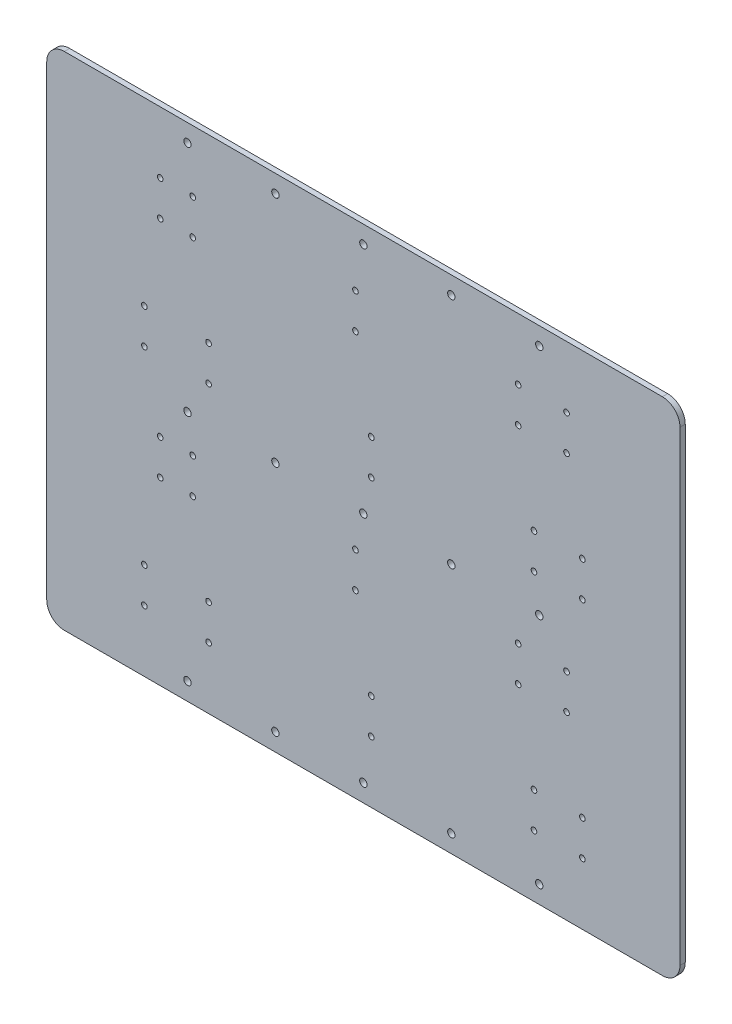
ISO-10303-21;
HEADER;
FILE_DESCRIPTION(('STEP AP214'),'2;1');
FILE_NAME('part.step','',(''),(''),'','','');
FILE_SCHEMA(('AUTOMOTIVE_DESIGN { 1 0 10303 214 1 1 1 1 }'));
ENDSEC;
DATA;
#1=APPLICATION_CONTEXT('core data for automotive mechanical design processes');
#2=APPLICATION_PROTOCOL_DEFINITION('international standard','automotive_design',2000,#1);
#3=PRODUCT_CONTEXT('',#1,'mechanical');
#4=PRODUCT('Part','Part','',(#3));
#5=PRODUCT_RELATED_PRODUCT_CATEGORY('part','',(#4));
#6=PRODUCT_DEFINITION_FORMATION('','',#4);
#7=PRODUCT_DEFINITION_CONTEXT('part definition',#1,'design');
#8=PRODUCT_DEFINITION('design','',#6,#7);
#9=PRODUCT_DEFINITION_SHAPE('','',#8);
#10=(LENGTH_UNIT() NAMED_UNIT(*) SI_UNIT(.MILLI.,.METRE.));
#11=(NAMED_UNIT(*) PLANE_ANGLE_UNIT() SI_UNIT($,.RADIAN.));
#12=(NAMED_UNIT(*) SI_UNIT($,.STERADIAN.) SOLID_ANGLE_UNIT());
#13=UNCERTAINTY_MEASURE_WITH_UNIT(LENGTH_MEASURE(1.E-05),#10,'distance_accuracy_value','');
#14=(GEOMETRIC_REPRESENTATION_CONTEXT(3) GLOBAL_UNCERTAINTY_ASSIGNED_CONTEXT((#13)) GLOBAL_UNIT_ASSIGNED_CONTEXT((#10,
#11,#12)) REPRESENTATION_CONTEXT('',''));
#15=CARTESIAN_POINT('',(0.,0.,0.));
#16=DIRECTION('',(0.,0.,1.));
#17=DIRECTION('',(1.,0.,0.));
#18=AXIS2_PLACEMENT_3D('',#15,#16,#17);
#19=CARTESIAN_POINT('',(0.,0.,3.));
#20=DIRECTION('',(1.,0.,0.));
#21=DIRECTION('',(0.,0.,-1.));
#22=AXIS2_PLACEMENT_3D('',#19,#20,#21);
#23=PLANE('',#22);
#24=DIRECTION('',(0.,-1.,0.));
#25=VECTOR('',#24,1.);
#26=CARTESIAN_POINT('',(0.,0.,0.));
#27=LINE('',#26,#25);
#28=CARTESIAN_POINT('',(0.,270.,0.));
#29=VERTEX_POINT('',#28);
#30=CARTESIAN_POINT('',(0.,5.,0.));
#31=VERTEX_POINT('',#30);
#32=EDGE_CURVE('E385',#29,#31,#27,.T.);
#33=ORIENTED_EDGE('',*,*,#32,.T.);
#34=DIRECTION('',(0.,0.,-1.));
#35=VECTOR('',#34,1.);
#36=CARTESIAN_POINT('',(0.,5.,3.));
#37=LINE('',#36,#35);
#38=CARTESIAN_POINT('',(0.,5.,3.));
#39=VERTEX_POINT('',#38);
#40=EDGE_CURVE('E109',#31,#39,#37,.F.);
#41=ORIENTED_EDGE('',*,*,#40,.T.);
#42=DIRECTION('',(0.,-1.,0.));
#43=VECTOR('',#42,1.);
#44=CARTESIAN_POINT('',(0.,0.,3.));
#45=LINE('',#44,#43);
#46=CARTESIAN_POINT('',(0.,270.,3.));
#47=VERTEX_POINT('',#46);
#48=EDGE_CURVE('E388',#47,#39,#45,.T.);
#49=ORIENTED_EDGE('',*,*,#48,.F.);
#50=DIRECTION('',(0.,0.,1.));
#51=VECTOR('',#50,1.);
#52=CARTESIAN_POINT('',(0.,270.,0.));
#53=LINE('',#52,#51);
#54=EDGE_CURVE('E114',#47,#29,#53,.F.);
#55=ORIENTED_EDGE('',*,*,#54,.T.);
#56=EDGE_LOOP('',(#33,#41,#49,#55));
#57=FACE_BOUND('',#56,.T.);
#58=ADVANCED_FACE('F36',(#57),#23,.F.);
#59=CARTESIAN_POINT('',(360.,0.,3.));
#60=DIRECTION('',(-1.,0.,0.));
#61=DIRECTION('',(0.,0.,1.));
#62=AXIS2_PLACEMENT_3D('',#59,#60,#61);
#63=PLANE('',#62);
#64=DIRECTION('',(0.,1.,0.));
#65=VECTOR('',#64,1.);
#66=CARTESIAN_POINT('',(360.,0.,3.));
#67=LINE('',#66,#65);
#68=CARTESIAN_POINT('',(360.,5.,3.));
#69=VERTEX_POINT('',#68);
#70=CARTESIAN_POINT('',(360.,270.,3.));
#71=VERTEX_POINT('',#70);
#72=EDGE_CURVE('E391',#69,#71,#67,.T.);
#73=ORIENTED_EDGE('',*,*,#72,.F.);
#74=DIRECTION('',(0.,0.,1.));
#75=VECTOR('',#74,1.);
#76=CARTESIAN_POINT('',(360.,5.,0.));
#77=LINE('',#76,#75);
#78=CARTESIAN_POINT('',(360.,5.,0.));
#79=VERTEX_POINT('',#78);
#80=EDGE_CURVE('E453',#69,#79,#77,.F.);
#81=ORIENTED_EDGE('',*,*,#80,.T.);
#82=DIRECTION('',(0.,1.,0.));
#83=VECTOR('',#82,1.);
#84=CARTESIAN_POINT('',(360.,0.,0.));
#85=LINE('',#84,#83);
#86=CARTESIAN_POINT('',(360.,270.,0.));
#87=VERTEX_POINT('',#86);
#88=EDGE_CURVE('E392',#79,#87,#85,.T.);
#89=ORIENTED_EDGE('',*,*,#88,.T.);
#90=DIRECTION('',(0.,0.,-1.));
#91=VECTOR('',#90,1.);
#92=CARTESIAN_POINT('',(360.,270.,3.));
#93=LINE('',#92,#91);
#94=EDGE_CURVE('E451',#87,#71,#93,.F.);
#95=ORIENTED_EDGE('',*,*,#94,.T.);
#96=EDGE_LOOP('',(#73,#81,#89,#95));
#97=FACE_BOUND('',#96,.T.);
#98=ADVANCED_FACE('F466',(#97),#63,.F.);
#99=CARTESIAN_POINT('',(0.,0.,3.));
#100=DIRECTION('',(0.,0.,-1.));
#101=DIRECTION('',(-1.,0.,0.));
#102=AXIS2_PLACEMENT_3D('',#99,#100,#101);
#103=PLANE('',#102);
#104=CARTESIAN_POINT('',(130.,5.,3.));
#105=DIRECTION('',(0.,0.,1.));
#106=DIRECTION('',(1.,0.,0.));
#107=AXIS2_PLACEMENT_3D('',#104,#105,#106);
#108=CIRCLE('',#107,2.09999999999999);
#109=CARTESIAN_POINT('',(132.1,5.,3.));
#110=VERTEX_POINT('',#109);
#111=EDGE_CURVE('E935',#110,#110,#108,.T.);
#112=ORIENTED_EDGE('',*,*,#111,.F.);
#113=EDGE_LOOP('',(#112));
#114=FACE_BOUND('',#113,.T.);
#115=CARTESIAN_POINT('',(80.,5.,3.));
#116=DIRECTION('',(0.,0.,1.));
#117=DIRECTION('',(1.,0.,0.));
#118=AXIS2_PLACEMENT_3D('',#115,#116,#117);
#119=CIRCLE('',#118,2.1);
#120=CARTESIAN_POINT('',(82.1,5.,3.));
#121=VERTEX_POINT('',#120);
#122=EDGE_CURVE('E937',#121,#121,#119,.T.);
#123=ORIENTED_EDGE('',*,*,#122,.F.);
#124=EDGE_LOOP('',(#123));
#125=FACE_BOUND('',#124,.T.);
#126=CARTESIAN_POINT('',(280.,5.00000000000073,3.));
#127=DIRECTION('',(0.,0.,1.));
#128=DIRECTION('',(-1.,0.,0.));
#129=AXIS2_PLACEMENT_3D('',#126,#127,#128);
#130=CIRCLE('',#129,2.09999999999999);
#131=CARTESIAN_POINT('',(277.9,5.00000000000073,3.));
#132=VERTEX_POINT('',#131);
#133=EDGE_CURVE('E941',#132,#132,#130,.T.);
#134=ORIENTED_EDGE('',*,*,#133,.F.);
#135=EDGE_LOOP('',(#134));
#136=FACE_BOUND('',#135,.T.);
#137=CARTESIAN_POINT('',(230.,5.00000000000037,3.));
#138=DIRECTION('',(0.,0.,1.));
#139=DIRECTION('',(-1.,0.,0.));
#140=AXIS2_PLACEMENT_3D('',#137,#138,#139);
#141=CIRCLE('',#140,2.09999999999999);
#142=CARTESIAN_POINT('',(227.9,5.00000000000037,3.));
#143=VERTEX_POINT('',#142);
#144=EDGE_CURVE('E949',#143,#143,#141,.T.);
#145=ORIENTED_EDGE('',*,*,#144,.F.);
#146=EDGE_LOOP('',(#145));
#147=FACE_BOUND('',#146,.T.);
#148=CARTESIAN_POINT('',(230.,270.,3.));
#149=DIRECTION('',(0.,0.,1.));
#150=DIRECTION('',(1.,0.,0.));
#151=AXIS2_PLACEMENT_3D('',#148,#149,#150);
#152=CIRCLE('',#151,2.09999999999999);
#153=CARTESIAN_POINT('',(232.1,270.,3.));
#154=VERTEX_POINT('',#153);
#155=EDGE_CURVE('E952',#154,#154,#152,.T.);
#156=ORIENTED_EDGE('',*,*,#155,.F.);
#157=EDGE_LOOP('',(#156));
#158=FACE_BOUND('',#157,.T.);
#159=CARTESIAN_POINT('',(280.,269.999999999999,3.));
#160=DIRECTION('',(0.,0.,1.));
#161=DIRECTION('',(1.,0.,0.));
#162=AXIS2_PLACEMENT_3D('',#159,#160,#161);
#163=CIRCLE('',#162,2.09999999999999);
#164=CARTESIAN_POINT('',(282.1,269.999999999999,3.));
#165=VERTEX_POINT('',#164);
#166=EDGE_CURVE('E955',#165,#165,#163,.T.);
#167=ORIENTED_EDGE('',*,*,#166,.F.);
#168=EDGE_LOOP('',(#167));
#169=FACE_BOUND('',#168,.T.);
#170=CARTESIAN_POINT('',(80.,270.,3.));
#171=DIRECTION('',(0.,0.,1.));
#172=DIRECTION('',(-1.,0.,0.));
#173=AXIS2_PLACEMENT_3D('',#170,#171,#172);
#174=CIRCLE('',#173,2.1);
#175=CARTESIAN_POINT('',(77.9,270.,3.));
#176=VERTEX_POINT('',#175);
#177=EDGE_CURVE('E958',#176,#176,#174,.T.);
#178=ORIENTED_EDGE('',*,*,#177,.F.);
#179=EDGE_LOOP('',(#178));
#180=FACE_BOUND('',#179,.T.);
#181=CARTESIAN_POINT('',(130.,270.,3.));
#182=DIRECTION('',(0.,0.,1.));
#183=DIRECTION('',(-1.,0.,0.));
#184=AXIS2_PLACEMENT_3D('',#181,#182,#183);
#185=CIRCLE('',#184,2.09999999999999);
#186=CARTESIAN_POINT('',(127.9,270.,3.));
#187=VERTEX_POINT('',#186);
#188=EDGE_CURVE('E960',#187,#187,#185,.T.);
#189=ORIENTED_EDGE('',*,*,#188,.F.);
#190=EDGE_LOOP('',(#189));
#191=FACE_BOUND('',#190,.T.);
#192=CARTESIAN_POINT('',(180.,270.,3.));
#193=DIRECTION('',(0.,0.,1.));
#194=DIRECTION('',(-1.,0.,0.));
#195=AXIS2_PLACEMENT_3D('',#192,#193,#194);
#196=CIRCLE('',#195,2.09999999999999);
#197=CARTESIAN_POINT('',(177.9,270.,3.));
#198=VERTEX_POINT('',#197);
#199=EDGE_CURVE('E962',#198,#198,#196,.T.);
#200=ORIENTED_EDGE('',*,*,#199,.F.);
#201=EDGE_LOOP('',(#200));
#202=FACE_BOUND('',#201,.T.);
#203=CARTESIAN_POINT('',(180.,137.5,3.));
#204=DIRECTION('',(0.,0.,1.));
#205=DIRECTION('',(1.,0.,0.));
#206=AXIS2_PLACEMENT_3D('',#203,#204,#205);
#207=CIRCLE('',#206,2.09999999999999);
#208=CARTESIAN_POINT('',(182.1,137.5,3.));
#209=VERTEX_POINT('',#208);
#210=EDGE_CURVE('E966',#209,#209,#207,.T.);
#211=ORIENTED_EDGE('',*,*,#210,.F.);
#212=EDGE_LOOP('',(#211));
#213=FACE_BOUND('',#212,.T.);
#214=CARTESIAN_POINT('',(130.,137.5,3.));
#215=DIRECTION('',(0.,0.,1.));
#216=DIRECTION('',(1.,0.,0.));
#217=AXIS2_PLACEMENT_3D('',#214,#215,#216);
#218=CIRCLE('',#217,2.09999999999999);
#219=CARTESIAN_POINT('',(132.1,137.5,3.));
#220=VERTEX_POINT('',#219);
#221=EDGE_CURVE('E971',#220,#220,#218,.T.);
#222=ORIENTED_EDGE('',*,*,#221,.F.);
#223=EDGE_LOOP('',(#222));
#224=FACE_BOUND('',#223,.T.);
#225=CARTESIAN_POINT('',(80.,137.5,3.));
#226=DIRECTION('',(0.,0.,1.));
#227=DIRECTION('',(1.,0.,0.));
#228=AXIS2_PLACEMENT_3D('',#225,#226,#227);
#229=CIRCLE('',#228,2.1);
#230=CARTESIAN_POINT('',(82.1,137.5,3.));
#231=VERTEX_POINT('',#230);
#232=EDGE_CURVE('E976',#231,#231,#229,.T.);
#233=ORIENTED_EDGE('',*,*,#232,.F.);
#234=EDGE_LOOP('',(#233));
#235=FACE_BOUND('',#234,.T.);
#236=CARTESIAN_POINT('',(280.,137.500000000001,3.));
#237=DIRECTION('',(0.,0.,1.));
#238=DIRECTION('',(-1.,0.,0.));
#239=AXIS2_PLACEMENT_3D('',#236,#237,#238);
#240=CIRCLE('',#239,2.09999999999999);
#241=CARTESIAN_POINT('',(277.9,137.500000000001,3.));
#242=VERTEX_POINT('',#241);
#243=EDGE_CURVE('E978',#242,#242,#240,.T.);
#244=ORIENTED_EDGE('',*,*,#243,.F.);
#245=EDGE_LOOP('',(#244));
#246=FACE_BOUND('',#245,.T.);
#247=CARTESIAN_POINT('',(230.,137.5,3.));
#248=DIRECTION('',(0.,0.,1.));
#249=DIRECTION('',(-1.,0.,0.));
#250=AXIS2_PLACEMENT_3D('',#247,#248,#249);
#251=CIRCLE('',#250,2.09999999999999);
#252=CARTESIAN_POINT('',(227.9,137.5,3.));
#253=VERTEX_POINT('',#252);
#254=EDGE_CURVE('E944',#253,#253,#251,.T.);
#255=ORIENTED_EDGE('',*,*,#254,.F.);
#256=EDGE_LOOP('',(#255));
#257=FACE_BOUND('',#256,.T.);
#258=CARTESIAN_POINT('',(180.,5.,3.));
#259=DIRECTION('',(0.,0.,1.));
#260=DIRECTION('',(1.,0.,0.));
#261=AXIS2_PLACEMENT_3D('',#258,#259,#260);
#262=CIRCLE('',#261,2.09999999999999);
#263=CARTESIAN_POINT('',(182.1,5.,3.));
#264=VERTEX_POINT('',#263);
#265=EDGE_CURVE('E140',#264,#264,#262,.T.);
#266=ORIENTED_EDGE('',*,*,#265,.F.);
#267=EDGE_LOOP('',(#266));
#268=FACE_BOUND('',#267,.T.);
#269=CARTESIAN_POINT('',(55.5,157.5,3.));
#270=DIRECTION('',(0.,0.,1.));
#271=DIRECTION('',(-1.,0.,0.));
#272=AXIS2_PLACEMENT_3D('',#269,#270,#271);
#273=CIRCLE('',#272,1.60000000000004);
#274=CARTESIAN_POINT('',(53.9,157.5,3.));
#275=VERTEX_POINT('',#274);
#276=EDGE_CURVE('E248',#275,#275,#273,.T.);
#277=ORIENTED_EDGE('',*,*,#276,.F.);
#278=EDGE_LOOP('',(#277));
#279=FACE_BOUND('',#278,.T.);
#280=CARTESIAN_POINT('',(55.5000000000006,30.,3.));
#281=DIRECTION('',(0.,0.,1.));
#282=DIRECTION('',(-1.,0.,0.));
#283=AXIS2_PLACEMENT_3D('',#280,#281,#282);
#284=CIRCLE('',#283,1.60000000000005);
#285=CARTESIAN_POINT('',(53.9000000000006,30.,3.));
#286=VERTEX_POINT('',#285);
#287=EDGE_CURVE('E242',#286,#286,#284,.T.);
#288=ORIENTED_EDGE('',*,*,#287,.F.);
#289=EDGE_LOOP('',(#288));
#290=FACE_BOUND('',#289,.T.);
#291=CARTESIAN_POINT('',(55.5000000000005,49.9999999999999,3.));
#292=DIRECTION('',(0.,0.,1.));
#293=DIRECTION('',(-1.,0.,0.));
#294=AXIS2_PLACEMENT_3D('',#291,#292,#293);
#295=CIRCLE('',#294,1.59999999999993);
#296=CARTESIAN_POINT('',(53.9000000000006,49.9999999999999,3.));
#297=VERTEX_POINT('',#296);
#298=EDGE_CURVE('E241',#297,#297,#295,.T.);
#299=ORIENTED_EDGE('',*,*,#298,.F.);
#300=EDGE_LOOP('',(#299));
#301=FACE_BOUND('',#300,.T.);
#302=CARTESIAN_POINT('',(64.4999999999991,97.4999999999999,3.));
#303=DIRECTION('',(0.,0.,1.));
#304=DIRECTION('',(-1.,0.,0.));
#305=AXIS2_PLACEMENT_3D('',#302,#303,#304);
#306=CIRCLE('',#305,1.60000000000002);
#307=CARTESIAN_POINT('',(62.8999999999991,97.4999999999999,3.));
#308=VERTEX_POINT('',#307);
#309=EDGE_CURVE('E256',#308,#308,#306,.T.);
#310=ORIENTED_EDGE('',*,*,#309,.F.);
#311=EDGE_LOOP('',(#310));
#312=FACE_BOUND('',#311,.T.);
#313=CARTESIAN_POINT('',(55.5,177.5,3.));
#314=DIRECTION('',(0.,0.,1.));
#315=DIRECTION('',(-1.,0.,0.));
#316=AXIS2_PLACEMENT_3D('',#313,#314,#315);
#317=CIRCLE('',#316,1.59999999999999);
#318=CARTESIAN_POINT('',(53.9,177.5,3.));
#319=VERTEX_POINT('',#318);
#320=EDGE_CURVE('E266',#319,#319,#317,.T.);
#321=ORIENTED_EDGE('',*,*,#320,.F.);
#322=EDGE_LOOP('',(#321));
#323=FACE_BOUND('',#322,.T.);
#324=CARTESIAN_POINT('',(64.5,225.,3.));
#325=DIRECTION('',(0.,0.,1.));
#326=DIRECTION('',(-1.,0.,0.));
#327=AXIS2_PLACEMENT_3D('',#324,#325,#326);
#328=CIRCLE('',#327,1.60000000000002);
#329=CARTESIAN_POINT('',(62.9,225.,3.));
#330=VERTEX_POINT('',#329);
#331=EDGE_CURVE('E272',#330,#330,#328,.T.);
#332=ORIENTED_EDGE('',*,*,#331,.F.);
#333=EDGE_LOOP('',(#332));
#334=FACE_BOUND('',#333,.T.);
#335=CARTESIAN_POINT('',(64.5,245.,3.));
#336=DIRECTION('',(0.,0.,1.));
#337=DIRECTION('',(-1.,0.,0.));
#338=AXIS2_PLACEMENT_3D('',#335,#336,#337);
#339=CIRCLE('',#338,1.60000000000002);
#340=CARTESIAN_POINT('',(62.9,245.,3.));
#341=VERTEX_POINT('',#340);
#342=EDGE_CURVE('E278',#341,#341,#339,.T.);
#343=ORIENTED_EDGE('',*,*,#342,.F.);
#344=EDGE_LOOP('',(#343));
#345=FACE_BOUND('',#344,.T.);
#346=CARTESIAN_POINT('',(268.,245.,3.));
#347=DIRECTION('',(0.,0.,1.));
#348=DIRECTION('',(1.,0.,0.));
#349=AXIS2_PLACEMENT_3D('',#346,#347,#348);
#350=CIRCLE('',#349,1.59999999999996);
#351=CARTESIAN_POINT('',(269.6,245.,3.));
#352=VERTEX_POINT('',#351);
#353=EDGE_CURVE('E217',#352,#352,#350,.T.);
#354=ORIENTED_EDGE('',*,*,#353,.F.);
#355=EDGE_LOOP('',(#354));
#356=FACE_BOUND('',#355,.T.);
#357=CARTESIAN_POINT('',(83.,244.999999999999,3.));
#358=DIRECTION('',(0.,0.,1.));
#359=DIRECTION('',(1.,0.,0.));
#360=AXIS2_PLACEMENT_3D('',#357,#358,#359);
#361=CIRCLE('',#360,1.59999999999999);
#362=CARTESIAN_POINT('',(84.6,244.999999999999,3.));
#363=VERTEX_POINT('',#362);
#364=EDGE_CURVE('E169',#363,#363,#361,.T.);
#365=ORIENTED_EDGE('',*,*,#364,.F.);
#366=EDGE_LOOP('',(#365));
#367=FACE_BOUND('',#366,.T.);
#368=CARTESIAN_POINT('',(268.000000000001,117.5,3.));
#369=DIRECTION('',(0.,0.,1.));
#370=DIRECTION('',(1.,0.,0.));
#371=AXIS2_PLACEMENT_3D('',#368,#369,#370);
#372=CIRCLE('',#371,1.59999999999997);
#373=CARTESIAN_POINT('',(269.600000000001,117.5,3.));
#374=VERTEX_POINT('',#373);
#375=EDGE_CURVE('E206',#374,#374,#372,.T.);
#376=ORIENTED_EDGE('',*,*,#375,.F.);
#377=EDGE_LOOP('',(#376));
#378=FACE_BOUND('',#377,.T.);
#379=CARTESIAN_POINT('',(268.000000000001,97.4999999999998,3.));
#380=DIRECTION('',(0.,0.,1.));
#381=DIRECTION('',(1.,0.,0.));
#382=AXIS2_PLACEMENT_3D('',#379,#380,#381);
#383=CIRCLE('',#382,1.60000000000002);
#384=CARTESIAN_POINT('',(269.600000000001,97.4999999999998,3.));
#385=VERTEX_POINT('',#384);
#386=EDGE_CURVE('E200',#385,#385,#383,.T.);
#387=ORIENTED_EDGE('',*,*,#386,.F.);
#388=EDGE_LOOP('',(#387));
#389=FACE_BOUND('',#388,.T.);
#390=CARTESIAN_POINT('',(277.,50.,3.));
#391=DIRECTION('',(0.,0.,1.));
#392=DIRECTION('',(1.,0.,0.));
#393=AXIS2_PLACEMENT_3D('',#390,#391,#392);
#394=CIRCLE('',#393,1.60000000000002);
#395=CARTESIAN_POINT('',(278.6,50.,3.));
#396=VERTEX_POINT('',#395);
#397=EDGE_CURVE('E194',#396,#396,#394,.T.);
#398=ORIENTED_EDGE('',*,*,#397,.F.);
#399=EDGE_LOOP('',(#398));
#400=FACE_BOUND('',#399,.T.);
#401=CARTESIAN_POINT('',(276.999999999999,30.,3.));
#402=DIRECTION('',(0.,0.,1.));
#403=DIRECTION('',(1.,0.,0.));
#404=AXIS2_PLACEMENT_3D('',#401,#402,#403);
#405=CIRCLE('',#404,1.60000000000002);
#406=CARTESIAN_POINT('',(278.599999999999,30.,3.));
#407=VERTEX_POINT('',#406);
#408=EDGE_CURVE('E193',#407,#407,#405,.T.);
#409=ORIENTED_EDGE('',*,*,#408,.F.);
#410=EDGE_LOOP('',(#409));
#411=FACE_BOUND('',#410,.T.);
#412=CARTESIAN_POINT('',(277.,157.5,3.));
#413=DIRECTION('',(0.,0.,1.));
#414=DIRECTION('',(1.,0.,0.));
#415=AXIS2_PLACEMENT_3D('',#412,#413,#414);
#416=CIRCLE('',#415,1.60000000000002);
#417=CARTESIAN_POINT('',(278.6,157.5,3.));
#418=VERTEX_POINT('',#417);
#419=EDGE_CURVE('E230',#418,#418,#416,.T.);
#420=ORIENTED_EDGE('',*,*,#419,.F.);
#421=EDGE_LOOP('',(#420));
#422=FACE_BOUND('',#421,.T.);
#423=CARTESIAN_POINT('',(277.,177.5,3.));
#424=DIRECTION('',(0.,0.,1.));
#425=DIRECTION('',(1.,0.,0.));
#426=AXIS2_PLACEMENT_3D('',#423,#424,#425);
#427=CIRCLE('',#426,1.59999999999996);
#428=CARTESIAN_POINT('',(278.6,177.5,3.));
#429=VERTEX_POINT('',#428);
#430=EDGE_CURVE('E224',#429,#429,#427,.T.);
#431=ORIENTED_EDGE('',*,*,#430,.F.);
#432=EDGE_LOOP('',(#431));
#433=FACE_BOUND('',#432,.T.);
#434=CARTESIAN_POINT('',(268.,225.,3.));
#435=DIRECTION('',(0.,0.,1.));
#436=DIRECTION('',(1.,0.,0.));
#437=AXIS2_PLACEMENT_3D('',#434,#435,#436);
#438=CIRCLE('',#437,1.59999999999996);
#439=CARTESIAN_POINT('',(269.6,225.,3.));
#440=VERTEX_POINT('',#439);
#441=EDGE_CURVE('E218',#440,#440,#438,.T.);
#442=ORIENTED_EDGE('',*,*,#441,.F.);
#443=EDGE_LOOP('',(#442));
#444=FACE_BOUND('',#443,.T.);
#445=CARTESIAN_POINT('',(295.5,245.,3.));
#446=DIRECTION('',(0.,0.,1.));
#447=DIRECTION('',(1.,0.,0.));
#448=AXIS2_PLACEMENT_3D('',#445,#446,#447);
#449=CIRCLE('',#448,1.59999999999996);
#450=CARTESIAN_POINT('',(297.1,245.,3.));
#451=VERTEX_POINT('',#450);
#452=EDGE_CURVE('E313',#451,#451,#449,.T.);
#453=ORIENTED_EDGE('',*,*,#452,.F.);
#454=EDGE_LOOP('',(#453));
#455=FACE_BOUND('',#454,.T.);
#456=CARTESIAN_POINT('',(175.500000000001,117.5,3.));
#457=DIRECTION('',(0.,0.,1.));
#458=DIRECTION('',(1.,0.,0.));
#459=AXIS2_PLACEMENT_3D('',#456,#457,#458);
#460=CIRCLE('',#459,1.59999999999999);
#461=CARTESIAN_POINT('',(177.100000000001,117.5,3.));
#462=VERTEX_POINT('',#461);
#463=EDGE_CURVE('E350',#462,#462,#460,.T.);
#464=ORIENTED_EDGE('',*,*,#463,.F.);
#465=EDGE_LOOP('',(#464));
#466=FACE_BOUND('',#465,.T.);
#467=CARTESIAN_POINT('',(175.500000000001,97.4999999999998,3.));
#468=DIRECTION('',(0.,0.,1.));
#469=DIRECTION('',(1.,0.,0.));
#470=AXIS2_PLACEMENT_3D('',#467,#468,#469);
#471=CIRCLE('',#470,1.59999999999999);
#472=CARTESIAN_POINT('',(177.100000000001,97.4999999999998,3.));
#473=VERTEX_POINT('',#472);
#474=EDGE_CURVE('E344',#473,#473,#471,.T.);
#475=ORIENTED_EDGE('',*,*,#474,.F.);
#476=EDGE_LOOP('',(#475));
#477=FACE_BOUND('',#476,.T.);
#478=CARTESIAN_POINT('',(184.5,50.,3.));
#479=DIRECTION('',(0.,0.,1.));
#480=DIRECTION('',(1.,0.,0.));
#481=AXIS2_PLACEMENT_3D('',#478,#479,#480);
#482=CIRCLE('',#481,1.59999999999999);
#483=CARTESIAN_POINT('',(186.1,50.,3.));
#484=VERTEX_POINT('',#483);
#485=EDGE_CURVE('E338',#484,#484,#482,.T.);
#486=ORIENTED_EDGE('',*,*,#485,.F.);
#487=EDGE_LOOP('',(#486));
#488=FACE_BOUND('',#487,.T.);
#489=CARTESIAN_POINT('',(184.499999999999,30.,3.));
#490=DIRECTION('',(0.,0.,1.));
#491=DIRECTION('',(1.,0.,0.));
#492=AXIS2_PLACEMENT_3D('',#489,#490,#491);
#493=CIRCLE('',#492,1.59999999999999);
#494=CARTESIAN_POINT('',(186.099999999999,30.,3.));
#495=VERTEX_POINT('',#494);
#496=EDGE_CURVE('E337',#495,#495,#493,.T.);
#497=ORIENTED_EDGE('',*,*,#496,.F.);
#498=EDGE_LOOP('',(#497));
#499=FACE_BOUND('',#498,.T.);
#500=CARTESIAN_POINT('',(184.5,157.5,3.));
#501=DIRECTION('',(0.,0.,1.));
#502=DIRECTION('',(1.,0.,0.));
#503=AXIS2_PLACEMENT_3D('',#500,#501,#502);
#504=CIRCLE('',#503,1.59999999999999);
#505=CARTESIAN_POINT('',(186.1,157.5,3.));
#506=VERTEX_POINT('',#505);
#507=EDGE_CURVE('E374',#506,#506,#504,.T.);
#508=ORIENTED_EDGE('',*,*,#507,.F.);
#509=EDGE_LOOP('',(#508));
#510=FACE_BOUND('',#509,.T.);
#511=CARTESIAN_POINT('',(184.5,177.5,3.));
#512=DIRECTION('',(0.,0.,1.));
#513=DIRECTION('',(1.,0.,0.));
#514=AXIS2_PLACEMENT_3D('',#511,#512,#513);
#515=CIRCLE('',#514,1.59999999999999);
#516=CARTESIAN_POINT('',(186.1,177.5,3.));
#517=VERTEX_POINT('',#516);
#518=EDGE_CURVE('E368',#517,#517,#515,.T.);
#519=ORIENTED_EDGE('',*,*,#518,.F.);
#520=EDGE_LOOP('',(#519));
#521=FACE_BOUND('',#520,.T.);
#522=CARTESIAN_POINT('',(175.5,225.,3.));
#523=DIRECTION('',(0.,0.,1.));
#524=DIRECTION('',(1.,0.,0.));
#525=AXIS2_PLACEMENT_3D('',#522,#523,#524);
#526=CIRCLE('',#525,1.59999999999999);
#527=CARTESIAN_POINT('',(177.1,225.,3.));
#528=VERTEX_POINT('',#527);
#529=EDGE_CURVE('E362',#528,#528,#526,.T.);
#530=ORIENTED_EDGE('',*,*,#529,.F.);
#531=EDGE_LOOP('',(#530));
#532=FACE_BOUND('',#531,.T.);
#533=CARTESIAN_POINT('',(64.499999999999,117.5,3.));
#534=DIRECTION('',(0.,0.,1.));
#535=DIRECTION('',(-1.,0.,0.));
#536=AXIS2_PLACEMENT_3D('',#533,#534,#535);
#537=CIRCLE('',#536,1.60000000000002);
#538=CARTESIAN_POINT('',(62.899999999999,117.5,3.));
#539=VERTEX_POINT('',#538);
#540=EDGE_CURVE('E255',#539,#539,#537,.T.);
#541=ORIENTED_EDGE('',*,*,#540,.F.);
#542=EDGE_LOOP('',(#541));
#543=FACE_BOUND('',#542,.T.);
#544=CARTESIAN_POINT('',(295.500000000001,117.5,3.));
#545=DIRECTION('',(0.,0.,1.));
#546=DIRECTION('',(1.,0.,0.));
#547=AXIS2_PLACEMENT_3D('',#544,#545,#546);
#548=CIRCLE('',#547,1.60000000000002);
#549=CARTESIAN_POINT('',(297.100000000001,117.5,3.));
#550=VERTEX_POINT('',#549);
#551=EDGE_CURVE('E302',#550,#550,#548,.T.);
#552=ORIENTED_EDGE('',*,*,#551,.F.);
#553=EDGE_LOOP('',(#552));
#554=FACE_BOUND('',#553,.T.);
#555=CARTESIAN_POINT('',(295.500000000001,97.4999999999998,3.));
#556=DIRECTION('',(0.,0.,1.));
#557=DIRECTION('',(1.,0.,0.));
#558=AXIS2_PLACEMENT_3D('',#555,#556,#557);
#559=CIRCLE('',#558,1.60000000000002);
#560=CARTESIAN_POINT('',(297.100000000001,97.4999999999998,3.));
#561=VERTEX_POINT('',#560);
#562=EDGE_CURVE('E296',#561,#561,#559,.T.);
#563=ORIENTED_EDGE('',*,*,#562,.F.);
#564=EDGE_LOOP('',(#563));
#565=FACE_BOUND('',#564,.T.);
#566=CARTESIAN_POINT('',(304.5,50.,3.));
#567=DIRECTION('',(0.,0.,1.));
#568=DIRECTION('',(1.,0.,0.));
#569=AXIS2_PLACEMENT_3D('',#566,#567,#568);
#570=CIRCLE('',#569,1.59999999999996);
#571=CARTESIAN_POINT('',(306.1,50.,3.));
#572=VERTEX_POINT('',#571);
#573=EDGE_CURVE('E290',#572,#572,#570,.T.);
#574=ORIENTED_EDGE('',*,*,#573,.F.);
#575=EDGE_LOOP('',(#574));
#576=FACE_BOUND('',#575,.T.);
#577=CARTESIAN_POINT('',(304.499999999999,30.,3.));
#578=DIRECTION('',(0.,0.,1.));
#579=DIRECTION('',(1.,0.,0.));
#580=AXIS2_PLACEMENT_3D('',#577,#578,#579);
#581=CIRCLE('',#580,1.59999999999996);
#582=CARTESIAN_POINT('',(306.099999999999,30.,3.));
#583=VERTEX_POINT('',#582);
#584=EDGE_CURVE('E289',#583,#583,#581,.T.);
#585=ORIENTED_EDGE('',*,*,#584,.F.);
#586=EDGE_LOOP('',(#585));
#587=FACE_BOUND('',#586,.T.);
#588=CARTESIAN_POINT('',(304.5,157.5,3.));
#589=DIRECTION('',(0.,0.,1.));
#590=DIRECTION('',(1.,0.,0.));
#591=AXIS2_PLACEMENT_3D('',#588,#589,#590);
#592=CIRCLE('',#591,1.60000000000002);
#593=CARTESIAN_POINT('',(306.1,157.5,3.));
#594=VERTEX_POINT('',#593);
#595=EDGE_CURVE('E326',#594,#594,#592,.T.);
#596=ORIENTED_EDGE('',*,*,#595,.F.);
#597=EDGE_LOOP('',(#596));
#598=FACE_BOUND('',#597,.T.);
#599=CARTESIAN_POINT('',(304.5,177.5,3.));
#600=DIRECTION('',(0.,0.,1.));
#601=DIRECTION('',(1.,0.,0.));
#602=AXIS2_PLACEMENT_3D('',#599,#600,#601);
#603=CIRCLE('',#602,1.60000000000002);
#604=CARTESIAN_POINT('',(306.1,177.5,3.));
#605=VERTEX_POINT('',#604);
#606=EDGE_CURVE('E320',#605,#605,#603,.T.);
#607=ORIENTED_EDGE('',*,*,#606,.F.);
#608=EDGE_LOOP('',(#607));
#609=FACE_BOUND('',#608,.T.);
#610=CARTESIAN_POINT('',(295.5,225.,3.));
#611=DIRECTION('',(0.,0.,1.));
#612=DIRECTION('',(1.,0.,0.));
#613=AXIS2_PLACEMENT_3D('',#610,#611,#612);
#614=CIRCLE('',#613,1.59999999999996);
#615=CARTESIAN_POINT('',(297.1,225.,3.));
#616=VERTEX_POINT('',#615);
#617=EDGE_CURVE('E314',#616,#616,#614,.T.);
#618=ORIENTED_EDGE('',*,*,#617,.F.);
#619=EDGE_LOOP('',(#618));
#620=FACE_BOUND('',#619,.T.);
#621=CARTESIAN_POINT('',(83.000000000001,117.499999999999,3.));
#622=DIRECTION('',(0.,0.,1.));
#623=DIRECTION('',(1.,0.,0.));
#624=AXIS2_PLACEMENT_3D('',#621,#622,#623);
#625=CIRCLE('',#624,1.59999999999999);
#626=CARTESIAN_POINT('',(84.600000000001,117.499999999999,3.));
#627=VERTEX_POINT('',#626);
#628=EDGE_CURVE('E147',#627,#627,#625,.T.);
#629=ORIENTED_EDGE('',*,*,#628,.F.);
#630=EDGE_LOOP('',(#629));
#631=FACE_BOUND('',#630,.T.);
#632=CARTESIAN_POINT('',(83.0000000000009,97.4999999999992,3.));
#633=DIRECTION('',(0.,0.,1.));
#634=DIRECTION('',(1.,0.,0.));
#635=AXIS2_PLACEMENT_3D('',#632,#633,#634);
#636=CIRCLE('',#635,1.59999999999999);
#637=CARTESIAN_POINT('',(84.6000000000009,97.4999999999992,3.));
#638=VERTEX_POINT('',#637);
#639=EDGE_CURVE('E158',#638,#638,#636,.T.);
#640=ORIENTED_EDGE('',*,*,#639,.F.);
#641=EDGE_LOOP('',(#640));
#642=FACE_BOUND('',#641,.T.);
#643=CARTESIAN_POINT('',(91.9999999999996,49.9999999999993,3.));
#644=DIRECTION('',(0.,0.,1.));
#645=DIRECTION('',(1.,0.,0.));
#646=AXIS2_PLACEMENT_3D('',#643,#644,#645);
#647=CIRCLE('',#646,1.59999999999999);
#648=CARTESIAN_POINT('',(93.5999999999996,49.9999999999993,3.));
#649=VERTEX_POINT('',#648);
#650=EDGE_CURVE('E152',#649,#649,#647,.T.);
#651=ORIENTED_EDGE('',*,*,#650,.F.);
#652=EDGE_LOOP('',(#651));
#653=FACE_BOUND('',#652,.T.);
#654=CARTESIAN_POINT('',(91.9999999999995,29.9999999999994,3.));
#655=DIRECTION('',(0.,0.,1.));
#656=DIRECTION('',(1.,0.,0.));
#657=AXIS2_PLACEMENT_3D('',#654,#655,#656);
#658=CIRCLE('',#657,1.59999999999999);
#659=CARTESIAN_POINT('',(93.5999999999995,29.9999999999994,3.));
#660=VERTEX_POINT('',#659);
#661=EDGE_CURVE('E151',#660,#660,#658,.T.);
#662=ORIENTED_EDGE('',*,*,#661,.F.);
#663=EDGE_LOOP('',(#662));
#664=FACE_BOUND('',#663,.T.);
#665=CARTESIAN_POINT('',(92.,157.499999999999,3.));
#666=DIRECTION('',(0.,0.,1.));
#667=DIRECTION('',(1.,0.,0.));
#668=AXIS2_PLACEMENT_3D('',#665,#666,#667);
#669=CIRCLE('',#668,1.59999999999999);
#670=CARTESIAN_POINT('',(93.6,157.499999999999,3.));
#671=VERTEX_POINT('',#670);
#672=EDGE_CURVE('E182',#671,#671,#669,.T.);
#673=ORIENTED_EDGE('',*,*,#672,.F.);
#674=EDGE_LOOP('',(#673));
#675=FACE_BOUND('',#674,.T.);
#676=CARTESIAN_POINT('',(92.,177.499999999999,3.));
#677=DIRECTION('',(0.,0.,1.));
#678=DIRECTION('',(1.,0.,0.));
#679=AXIS2_PLACEMENT_3D('',#676,#677,#678);
#680=CIRCLE('',#679,1.59999999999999);
#681=CARTESIAN_POINT('',(93.6,177.499999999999,3.));
#682=VERTEX_POINT('',#681);
#683=EDGE_CURVE('E176',#682,#682,#680,.T.);
#684=ORIENTED_EDGE('',*,*,#683,.F.);
#685=EDGE_LOOP('',(#684));
#686=FACE_BOUND('',#685,.T.);
#687=CARTESIAN_POINT('',(83.,224.999999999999,3.));
#688=DIRECTION('',(0.,0.,1.));
#689=DIRECTION('',(1.,0.,0.));
#690=AXIS2_PLACEMENT_3D('',#687,#688,#689);
#691=CIRCLE('',#690,1.59999999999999);
#692=CARTESIAN_POINT('',(84.6,224.999999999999,3.));
#693=VERTEX_POINT('',#692);
#694=EDGE_CURVE('E170',#693,#693,#691,.T.);
#695=ORIENTED_EDGE('',*,*,#694,.F.);
#696=EDGE_LOOP('',(#695));
#697=FACE_BOUND('',#696,.T.);
#698=CARTESIAN_POINT('',(175.5,245.,3.));
#699=DIRECTION('',(0.,0.,1.));
#700=DIRECTION('',(1.,0.,0.));
#701=AXIS2_PLACEMENT_3D('',#698,#699,#700);
#702=CIRCLE('',#701,1.59999999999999);
#703=CARTESIAN_POINT('',(177.1,245.,3.));
#704=VERTEX_POINT('',#703);
#705=EDGE_CURVE('E361',#704,#704,#702,.T.);
#706=ORIENTED_EDGE('',*,*,#705,.F.);
#707=EDGE_LOOP('',(#706));
#708=FACE_BOUND('',#707,.T.);
#709=ORIENTED_EDGE('',*,*,#48,.T.);
#710=CARTESIAN_POINT('',(10.,5.,3.));
#711=DIRECTION('',(0.,0.,-1.));
#712=DIRECTION('',(-1.,0.,0.));
#713=AXIS2_PLACEMENT_3D('',#710,#711,#712);
#714=CIRCLE('',#713,10.);
#715=CARTESIAN_POINT('',(10.0000000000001,-5.,3.));
#716=VERTEX_POINT('',#715);
#717=EDGE_CURVE('E449',#39,#716,#714,.F.);
#718=ORIENTED_EDGE('',*,*,#717,.T.);
#719=DIRECTION('',(-1.,0.,0.));
#720=VECTOR('',#719,1.);
#721=CARTESIAN_POINT('',(360.,-5.,3.));
#722=LINE('',#721,#720);
#723=CARTESIAN_POINT('',(350.,-5.,3.));
#724=VERTEX_POINT('',#723);
#725=EDGE_CURVE('E125',#724,#716,#722,.T.);
#726=ORIENTED_EDGE('',*,*,#725,.F.);
#727=CARTESIAN_POINT('',(350.,5.,3.));
#728=DIRECTION('',(0.,0.,-1.));
#729=DIRECTION('',(-1.,0.,0.));
#730=AXIS2_PLACEMENT_3D('',#727,#728,#729);
#731=CIRCLE('',#730,10.);
#732=EDGE_CURVE('E447',#724,#69,#731,.F.);
#733=ORIENTED_EDGE('',*,*,#732,.T.);
#734=ORIENTED_EDGE('',*,*,#72,.T.);
#735=CARTESIAN_POINT('',(350.,270.,3.));
#736=DIRECTION('',(0.,0.,-1.));
#737=DIRECTION('',(-1.,0.,0.));
#738=AXIS2_PLACEMENT_3D('',#735,#736,#737);
#739=CIRCLE('',#738,10.);
#740=CARTESIAN_POINT('',(350.,280.,3.));
#741=VERTEX_POINT('',#740);
#742=EDGE_CURVE('E51',#71,#741,#739,.F.);
#743=ORIENTED_EDGE('',*,*,#742,.T.);
#744=DIRECTION('',(1.,0.,0.));
#745=VECTOR('',#744,1.);
#746=CARTESIAN_POINT('',(0.,280.,3.));
#747=LINE('',#746,#745);
#748=CARTESIAN_POINT('',(10.,280.,3.));
#749=VERTEX_POINT('',#748);
#750=EDGE_CURVE('E145',#749,#741,#747,.T.);
#751=ORIENTED_EDGE('',*,*,#750,.F.);
#752=CARTESIAN_POINT('',(10.,270.,3.));
#753=DIRECTION('',(0.,0.,-1.));
#754=DIRECTION('',(-1.,0.,0.));
#755=AXIS2_PLACEMENT_3D('',#752,#753,#754);
#756=CIRCLE('',#755,10.);
#757=EDGE_CURVE('E59',#749,#47,#756,.F.);
#758=ORIENTED_EDGE('',*,*,#757,.T.);
#759=EDGE_LOOP('',(#709,#718,#726,#733,#734,#743,#751,#758));
#760=FACE_BOUND('',#759,.T.);
#761=ADVANCED_FACE('F459',(#114,#125,#136,#147,#158,#169,#180,#191,#202,#213,#224,#235,#246,
#257,#268,#279,#290,#301,#312,#323,#334,#345,#356,#367,#378,#389,#400,#411,#422,#433,#444,#455,
#466,#477,#488,#499,#510,#521,#532,#543,#554,#565,#576,#587,#598,#609,#620,#631,#642,#653,#664,
#675,#686,#697,#708,#760),#103,.F.);
#762=CARTESIAN_POINT('',(0.,0.,0.));
#763=DIRECTION('',(0.,0.,-1.));
#764=DIRECTION('',(-1.,0.,0.));
#765=AXIS2_PLACEMENT_3D('',#762,#763,#764);
#766=PLANE('',#765);
#767=CARTESIAN_POINT('',(130.,5.,0.));
#768=DIRECTION('',(0.,0.,-1.));
#769=DIRECTION('',(-1.,0.,0.));
#770=AXIS2_PLACEMENT_3D('',#767,#768,#769);
#771=CIRCLE('',#770,2.09999999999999);
#772=CARTESIAN_POINT('',(127.9,5.,0.));
#773=VERTEX_POINT('',#772);
#774=EDGE_CURVE('E132',#773,#773,#771,.T.);
#775=ORIENTED_EDGE('',*,*,#774,.F.);
#776=EDGE_LOOP('',(#775));
#777=FACE_BOUND('',#776,.T.);
#778=CARTESIAN_POINT('',(80.,5.,0.));
#779=DIRECTION('',(0.,0.,-1.));
#780=DIRECTION('',(-1.,0.,0.));
#781=AXIS2_PLACEMENT_3D('',#778,#779,#780);
#782=CIRCLE('',#781,2.1);
#783=CARTESIAN_POINT('',(77.9,5.,0.));
#784=VERTEX_POINT('',#783);
#785=EDGE_CURVE('E137',#784,#784,#782,.T.);
#786=ORIENTED_EDGE('',*,*,#785,.F.);
#787=EDGE_LOOP('',(#786));
#788=FACE_BOUND('',#787,.T.);
#789=CARTESIAN_POINT('',(280.,5.00000000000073,0.));
#790=DIRECTION('',(0.,0.,-1.));
#791=DIRECTION('',(-1.,0.,0.));
#792=AXIS2_PLACEMENT_3D('',#789,#790,#791);
#793=CIRCLE('',#792,2.09999999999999);
#794=CARTESIAN_POINT('',(277.9,5.00000000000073,0.));
#795=VERTEX_POINT('',#794);
#796=EDGE_CURVE('E433',#795,#795,#793,.T.);
#797=ORIENTED_EDGE('',*,*,#796,.F.);
#798=EDGE_LOOP('',(#797));
#799=FACE_BOUND('',#798,.T.);
#800=CARTESIAN_POINT('',(230.,5.00000000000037,0.));
#801=DIRECTION('',(0.,0.,-1.));
#802=DIRECTION('',(-1.,0.,0.));
#803=AXIS2_PLACEMENT_3D('',#800,#801,#802);
#804=CIRCLE('',#803,2.09999999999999);
#805=CARTESIAN_POINT('',(227.9,5.00000000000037,0.));
#806=VERTEX_POINT('',#805);
#807=EDGE_CURVE('E430',#806,#806,#804,.T.);
#808=ORIENTED_EDGE('',*,*,#807,.F.);
#809=EDGE_LOOP('',(#808));
#810=FACE_BOUND('',#809,.T.);
#811=CARTESIAN_POINT('',(230.,270.,0.));
#812=DIRECTION('',(0.,0.,-1.));
#813=DIRECTION('',(-1.,0.,0.));
#814=AXIS2_PLACEMENT_3D('',#811,#812,#813);
#815=CIRCLE('',#814,2.09999999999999);
#816=CARTESIAN_POINT('',(227.9,270.,0.));
#817=VERTEX_POINT('',#816);
#818=EDGE_CURVE('E427',#817,#817,#815,.T.);
#819=ORIENTED_EDGE('',*,*,#818,.F.);
#820=EDGE_LOOP('',(#819));
#821=FACE_BOUND('',#820,.T.);
#822=CARTESIAN_POINT('',(280.,269.999999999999,0.));
#823=DIRECTION('',(0.,0.,-1.));
#824=DIRECTION('',(-1.,0.,0.));
#825=AXIS2_PLACEMENT_3D('',#822,#823,#824);
#826=CIRCLE('',#825,2.09999999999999);
#827=CARTESIAN_POINT('',(277.9,269.999999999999,0.));
#828=VERTEX_POINT('',#827);
#829=EDGE_CURVE('E424',#828,#828,#826,.T.);
#830=ORIENTED_EDGE('',*,*,#829,.F.);
#831=EDGE_LOOP('',(#830));
#832=FACE_BOUND('',#831,.T.);
#833=CARTESIAN_POINT('',(80.,270.,0.));
#834=DIRECTION('',(0.,0.,-1.));
#835=DIRECTION('',(-1.,0.,0.));
#836=AXIS2_PLACEMENT_3D('',#833,#834,#835);
#837=CIRCLE('',#836,2.1);
#838=CARTESIAN_POINT('',(77.9,270.,0.));
#839=VERTEX_POINT('',#838);
#840=EDGE_CURVE('E421',#839,#839,#837,.T.);
#841=ORIENTED_EDGE('',*,*,#840,.F.);
#842=EDGE_LOOP('',(#841));
#843=FACE_BOUND('',#842,.T.);
#844=CARTESIAN_POINT('',(130.,270.,0.));
#845=DIRECTION('',(0.,0.,-1.));
#846=DIRECTION('',(-1.,0.,0.));
#847=AXIS2_PLACEMENT_3D('',#844,#845,#846);
#848=CIRCLE('',#847,2.09999999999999);
#849=CARTESIAN_POINT('',(127.9,270.,0.));
#850=VERTEX_POINT('',#849);
#851=EDGE_CURVE('E418',#850,#850,#848,.T.);
#852=ORIENTED_EDGE('',*,*,#851,.F.);
#853=EDGE_LOOP('',(#852));
#854=FACE_BOUND('',#853,.T.);
#855=CARTESIAN_POINT('',(180.,270.,0.));
#856=DIRECTION('',(0.,0.,-1.));
#857=DIRECTION('',(-1.,0.,0.));
#858=AXIS2_PLACEMENT_3D('',#855,#856,#857);
#859=CIRCLE('',#858,2.09999999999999);
#860=CARTESIAN_POINT('',(177.9,270.,0.));
#861=VERTEX_POINT('',#860);
#862=EDGE_CURVE('E415',#861,#861,#859,.T.);
#863=ORIENTED_EDGE('',*,*,#862,.F.);
#864=EDGE_LOOP('',(#863));
#865=FACE_BOUND('',#864,.T.);
#866=CARTESIAN_POINT('',(180.,137.5,0.));
#867=DIRECTION('',(0.,0.,-1.));
#868=DIRECTION('',(-1.,0.,0.));
#869=AXIS2_PLACEMENT_3D('',#866,#867,#868);
#870=CIRCLE('',#869,2.09999999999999);
#871=CARTESIAN_POINT('',(177.9,137.5,0.));
#872=VERTEX_POINT('',#871);
#873=EDGE_CURVE('E412',#872,#872,#870,.T.);
#874=ORIENTED_EDGE('',*,*,#873,.F.);
#875=EDGE_LOOP('',(#874));
#876=FACE_BOUND('',#875,.T.);
#877=CARTESIAN_POINT('',(130.,137.5,0.));
#878=DIRECTION('',(0.,0.,-1.));
#879=DIRECTION('',(-1.,0.,0.));
#880=AXIS2_PLACEMENT_3D('',#877,#878,#879);
#881=CIRCLE('',#880,2.09999999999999);
#882=CARTESIAN_POINT('',(127.9,137.5,0.));
#883=VERTEX_POINT('',#882);
#884=EDGE_CURVE('E409',#883,#883,#881,.T.);
#885=ORIENTED_EDGE('',*,*,#884,.F.);
#886=EDGE_LOOP('',(#885));
#887=FACE_BOUND('',#886,.T.);
#888=CARTESIAN_POINT('',(80.,137.5,0.));
#889=DIRECTION('',(0.,0.,-1.));
#890=DIRECTION('',(-1.,0.,0.));
#891=AXIS2_PLACEMENT_3D('',#888,#889,#890);
#892=CIRCLE('',#891,2.1);
#893=CARTESIAN_POINT('',(77.9,137.5,0.));
#894=VERTEX_POINT('',#893);
#895=EDGE_CURVE('E406',#894,#894,#892,.T.);
#896=ORIENTED_EDGE('',*,*,#895,.F.);
#897=EDGE_LOOP('',(#896));
#898=FACE_BOUND('',#897,.T.);
#899=CARTESIAN_POINT('',(280.,137.500000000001,0.));
#900=DIRECTION('',(0.,0.,-1.));
#901=DIRECTION('',(-1.,0.,0.));
#902=AXIS2_PLACEMENT_3D('',#899,#900,#901);
#903=CIRCLE('',#902,2.09999999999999);
#904=CARTESIAN_POINT('',(277.9,137.500000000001,0.));
#905=VERTEX_POINT('',#904);
#906=EDGE_CURVE('E403',#905,#905,#903,.T.);
#907=ORIENTED_EDGE('',*,*,#906,.F.);
#908=EDGE_LOOP('',(#907));
#909=FACE_BOUND('',#908,.T.);
#910=CARTESIAN_POINT('',(230.,137.5,0.));
#911=DIRECTION('',(0.,0.,-1.));
#912=DIRECTION('',(-1.,0.,0.));
#913=AXIS2_PLACEMENT_3D('',#910,#911,#912);
#914=CIRCLE('',#913,2.09999999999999);
#915=CARTESIAN_POINT('',(227.9,137.5,0.));
#916=VERTEX_POINT('',#915);
#917=EDGE_CURVE('E400',#916,#916,#914,.T.);
#918=ORIENTED_EDGE('',*,*,#917,.F.);
#919=EDGE_LOOP('',(#918));
#920=FACE_BOUND('',#919,.T.);
#921=CARTESIAN_POINT('',(180.,5.,0.));
#922=DIRECTION('',(0.,0.,-1.));
#923=DIRECTION('',(-1.,0.,0.));
#924=AXIS2_PLACEMENT_3D('',#921,#922,#923);
#925=CIRCLE('',#924,2.09999999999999);
#926=CARTESIAN_POINT('',(177.9,5.,0.));
#927=VERTEX_POINT('',#926);
#928=EDGE_CURVE('E397',#927,#927,#925,.T.);
#929=ORIENTED_EDGE('',*,*,#928,.F.);
#930=EDGE_LOOP('',(#929));
#931=FACE_BOUND('',#930,.T.);
#932=CARTESIAN_POINT('',(55.5,157.5,0.));
#933=DIRECTION('',(0.,0.,1.));
#934=DIRECTION('',(-1.,0.,0.));
#935=AXIS2_PLACEMENT_3D('',#932,#933,#934);
#936=CIRCLE('',#935,1.60000000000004);
#937=CARTESIAN_POINT('',(53.9,157.5,0.));
#938=VERTEX_POINT('',#937);
#939=EDGE_CURVE('E245',#938,#938,#936,.T.);
#940=ORIENTED_EDGE('',*,*,#939,.T.);
#941=EDGE_LOOP('',(#940));
#942=FACE_BOUND('',#941,.T.);
#943=CARTESIAN_POINT('',(55.5000000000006,30.,0.));
#944=DIRECTION('',(0.,0.,1.));
#945=DIRECTION('',(-1.,0.,0.));
#946=AXIS2_PLACEMENT_3D('',#943,#944,#945);
#947=CIRCLE('',#946,1.60000000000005);
#948=CARTESIAN_POINT('',(53.9000000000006,30.,0.));
#949=VERTEX_POINT('',#948);
#950=EDGE_CURVE('E238',#949,#949,#947,.T.);
#951=ORIENTED_EDGE('',*,*,#950,.T.);
#952=EDGE_LOOP('',(#951));
#953=FACE_BOUND('',#952,.T.);
#954=CARTESIAN_POINT('',(55.5000000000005,49.9999999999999,0.));
#955=DIRECTION('',(0.,0.,1.));
#956=DIRECTION('',(-1.,0.,0.));
#957=AXIS2_PLACEMENT_3D('',#954,#955,#956);
#958=CIRCLE('',#957,1.59999999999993);
#959=CARTESIAN_POINT('',(53.9000000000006,49.9999999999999,0.));
#960=VERTEX_POINT('',#959);
#961=EDGE_CURVE('E259',#960,#960,#958,.T.);
#962=ORIENTED_EDGE('',*,*,#961,.T.);
#963=EDGE_LOOP('',(#962));
#964=FACE_BOUND('',#963,.T.);
#965=CARTESIAN_POINT('',(64.4999999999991,97.4999999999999,0.));
#966=DIRECTION('',(0.,0.,1.));
#967=DIRECTION('',(-1.,0.,0.));
#968=AXIS2_PLACEMENT_3D('',#965,#966,#967);
#969=CIRCLE('',#968,1.60000000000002);
#970=CARTESIAN_POINT('',(62.8999999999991,97.4999999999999,0.));
#971=VERTEX_POINT('',#970);
#972=EDGE_CURVE('E252',#971,#971,#969,.T.);
#973=ORIENTED_EDGE('',*,*,#972,.T.);
#974=EDGE_LOOP('',(#973));
#975=FACE_BOUND('',#974,.T.);
#976=CARTESIAN_POINT('',(55.5,177.5,0.));
#977=DIRECTION('',(0.,0.,1.));
#978=DIRECTION('',(-1.,0.,0.));
#979=AXIS2_PLACEMENT_3D('',#976,#977,#978);
#980=CIRCLE('',#979,1.59999999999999);
#981=CARTESIAN_POINT('',(53.9,177.5,0.));
#982=VERTEX_POINT('',#981);
#983=EDGE_CURVE('E251',#982,#982,#980,.T.);
#984=ORIENTED_EDGE('',*,*,#983,.T.);
#985=EDGE_LOOP('',(#984));
#986=FACE_BOUND('',#985,.T.);
#987=CARTESIAN_POINT('',(64.5,225.,0.));
#988=DIRECTION('',(0.,0.,1.));
#989=DIRECTION('',(-1.,0.,0.));
#990=AXIS2_PLACEMENT_3D('',#987,#988,#989);
#991=CIRCLE('',#990,1.60000000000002);
#992=CARTESIAN_POINT('',(62.9,225.,0.));
#993=VERTEX_POINT('',#992);
#994=EDGE_CURVE('E269',#993,#993,#991,.T.);
#995=ORIENTED_EDGE('',*,*,#994,.T.);
#996=EDGE_LOOP('',(#995));
#997=FACE_BOUND('',#996,.T.);
#998=CARTESIAN_POINT('',(64.5,245.,0.));
#999=DIRECTION('',(0.,0.,1.));
#1000=DIRECTION('',(-1.,0.,0.));
#1001=AXIS2_PLACEMENT_3D('',#998,#999,#1000);
#1002=CIRCLE('',#1001,1.60000000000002);
#1003=CARTESIAN_POINT('',(62.9,245.,0.));
#1004=VERTEX_POINT('',#1003);
#1005=EDGE_CURVE('E275',#1004,#1004,#1002,.T.);
#1006=ORIENTED_EDGE('',*,*,#1005,.T.);
#1007=EDGE_LOOP('',(#1006));
#1008=FACE_BOUND('',#1007,.T.);
#1009=CARTESIAN_POINT('',(268.,245.,0.));
#1010=DIRECTION('',(0.,0.,1.));
#1011=DIRECTION('',(1.,0.,0.));
#1012=AXIS2_PLACEMENT_3D('',#1009,#1010,#1011);
#1013=CIRCLE('',#1012,1.59999999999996);
#1014=CARTESIAN_POINT('',(269.6,245.,0.));
#1015=VERTEX_POINT('',#1014);
#1016=EDGE_CURVE('E281',#1015,#1015,#1013,.T.);
#1017=ORIENTED_EDGE('',*,*,#1016,.T.);
#1018=EDGE_LOOP('',(#1017));
#1019=FACE_BOUND('',#1018,.T.);
#1020=CARTESIAN_POINT('',(83.,244.999999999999,0.));
#1021=DIRECTION('',(0.,0.,1.));
#1022=DIRECTION('',(1.,0.,0.));
#1023=AXIS2_PLACEMENT_3D('',#1020,#1021,#1022);
#1024=CIRCLE('',#1023,1.59999999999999);
#1025=CARTESIAN_POINT('',(84.6,244.999999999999,0.));
#1026=VERTEX_POINT('',#1025);
#1027=EDGE_CURVE('E209',#1026,#1026,#1024,.T.);
#1028=ORIENTED_EDGE('',*,*,#1027,.T.);
#1029=EDGE_LOOP('',(#1028));
#1030=FACE_BOUND('',#1029,.T.);
#1031=CARTESIAN_POINT('',(268.000000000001,117.5,0.));
#1032=DIRECTION('',(0.,0.,1.));
#1033=DIRECTION('',(1.,0.,0.));
#1034=AXIS2_PLACEMENT_3D('',#1031,#1032,#1033);
#1035=CIRCLE('',#1034,1.59999999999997);
#1036=CARTESIAN_POINT('',(269.600000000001,117.5,0.));
#1037=VERTEX_POINT('',#1036);
#1038=EDGE_CURVE('E203',#1037,#1037,#1035,.T.);
#1039=ORIENTED_EDGE('',*,*,#1038,.T.);
#1040=EDGE_LOOP('',(#1039));
#1041=FACE_BOUND('',#1040,.T.);
#1042=CARTESIAN_POINT('',(268.000000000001,97.4999999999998,0.));
#1043=DIRECTION('',(0.,0.,1.));
#1044=DIRECTION('',(1.,0.,0.));
#1045=AXIS2_PLACEMENT_3D('',#1042,#1043,#1044);
#1046=CIRCLE('',#1045,1.60000000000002);
#1047=CARTESIAN_POINT('',(269.600000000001,97.4999999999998,0.));
#1048=VERTEX_POINT('',#1047);
#1049=EDGE_CURVE('E197',#1048,#1048,#1046,.T.);
#1050=ORIENTED_EDGE('',*,*,#1049,.T.);
#1051=EDGE_LOOP('',(#1050));
#1052=FACE_BOUND('',#1051,.T.);
#1053=CARTESIAN_POINT('',(277.,50.,0.));
#1054=DIRECTION('',(0.,0.,1.));
#1055=DIRECTION('',(1.,0.,0.));
#1056=AXIS2_PLACEMENT_3D('',#1053,#1054,#1055);
#1057=CIRCLE('',#1056,1.60000000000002);
#1058=CARTESIAN_POINT('',(278.6,50.,0.));
#1059=VERTEX_POINT('',#1058);
#1060=EDGE_CURVE('E190',#1059,#1059,#1057,.T.);
#1061=ORIENTED_EDGE('',*,*,#1060,.T.);
#1062=EDGE_LOOP('',(#1061));
#1063=FACE_BOUND('',#1062,.T.);
#1064=CARTESIAN_POINT('',(276.999999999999,30.,0.));
#1065=DIRECTION('',(0.,0.,1.));
#1066=DIRECTION('',(1.,0.,0.));
#1067=AXIS2_PLACEMENT_3D('',#1064,#1065,#1066);
#1068=CIRCLE('',#1067,1.60000000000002);
#1069=CARTESIAN_POINT('',(278.599999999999,30.,0.));
#1070=VERTEX_POINT('',#1069);
#1071=EDGE_CURVE('E233',#1070,#1070,#1068,.T.);
#1072=ORIENTED_EDGE('',*,*,#1071,.T.);
#1073=EDGE_LOOP('',(#1072));
#1074=FACE_BOUND('',#1073,.T.);
#1075=CARTESIAN_POINT('',(277.,157.5,0.));
#1076=DIRECTION('',(0.,0.,1.));
#1077=DIRECTION('',(1.,0.,0.));
#1078=AXIS2_PLACEMENT_3D('',#1075,#1076,#1077);
#1079=CIRCLE('',#1078,1.60000000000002);
#1080=CARTESIAN_POINT('',(278.6,157.5,0.));
#1081=VERTEX_POINT('',#1080);
#1082=EDGE_CURVE('E227',#1081,#1081,#1079,.T.);
#1083=ORIENTED_EDGE('',*,*,#1082,.T.);
#1084=EDGE_LOOP('',(#1083));
#1085=FACE_BOUND('',#1084,.T.);
#1086=CARTESIAN_POINT('',(277.,177.5,0.));
#1087=DIRECTION('',(0.,0.,1.));
#1088=DIRECTION('',(1.,0.,0.));
#1089=AXIS2_PLACEMENT_3D('',#1086,#1087,#1088);
#1090=CIRCLE('',#1089,1.59999999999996);
#1091=CARTESIAN_POINT('',(278.6,177.5,0.));
#1092=VERTEX_POINT('',#1091);
#1093=EDGE_CURVE('E221',#1092,#1092,#1090,.T.);
#1094=ORIENTED_EDGE('',*,*,#1093,.T.);
#1095=EDGE_LOOP('',(#1094));
#1096=FACE_BOUND('',#1095,.T.);
#1097=CARTESIAN_POINT('',(268.,225.,0.));
#1098=DIRECTION('',(0.,0.,1.));
#1099=DIRECTION('',(1.,0.,0.));
#1100=AXIS2_PLACEMENT_3D('',#1097,#1098,#1099);
#1101=CIRCLE('',#1100,1.59999999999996);
#1102=CARTESIAN_POINT('',(269.6,225.,0.));
#1103=VERTEX_POINT('',#1102);
#1104=EDGE_CURVE('E214',#1103,#1103,#1101,.T.);
#1105=ORIENTED_EDGE('',*,*,#1104,.T.);
#1106=EDGE_LOOP('',(#1105));
#1107=FACE_BOUND('',#1106,.T.);
#1108=CARTESIAN_POINT('',(295.5,245.,0.));
#1109=DIRECTION('',(0.,0.,1.));
#1110=DIRECTION('',(1.,0.,0.));
#1111=AXIS2_PLACEMENT_3D('',#1108,#1109,#1110);
#1112=CIRCLE('',#1111,1.59999999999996);
#1113=CARTESIAN_POINT('',(297.1,245.,0.));
#1114=VERTEX_POINT('',#1113);
#1115=EDGE_CURVE('E353',#1114,#1114,#1112,.T.);
#1116=ORIENTED_EDGE('',*,*,#1115,.T.);
#1117=EDGE_LOOP('',(#1116));
#1118=FACE_BOUND('',#1117,.T.);
#1119=CARTESIAN_POINT('',(175.500000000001,117.5,0.));
#1120=DIRECTION('',(0.,0.,1.));
#1121=DIRECTION('',(1.,0.,0.));
#1122=AXIS2_PLACEMENT_3D('',#1119,#1120,#1121);
#1123=CIRCLE('',#1122,1.59999999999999);
#1124=CARTESIAN_POINT('',(177.100000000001,117.5,0.));
#1125=VERTEX_POINT('',#1124);
#1126=EDGE_CURVE('E347',#1125,#1125,#1123,.T.);
#1127=ORIENTED_EDGE('',*,*,#1126,.T.);
#1128=EDGE_LOOP('',(#1127));
#1129=FACE_BOUND('',#1128,.T.);
#1130=CARTESIAN_POINT('',(175.500000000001,97.4999999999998,0.));
#1131=DIRECTION('',(0.,0.,1.));
#1132=DIRECTION('',(1.,0.,0.));
#1133=AXIS2_PLACEMENT_3D('',#1130,#1131,#1132);
#1134=CIRCLE('',#1133,1.59999999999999);
#1135=CARTESIAN_POINT('',(177.100000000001,97.4999999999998,0.));
#1136=VERTEX_POINT('',#1135);
#1137=EDGE_CURVE('E341',#1136,#1136,#1134,.T.);
#1138=ORIENTED_EDGE('',*,*,#1137,.T.);
#1139=EDGE_LOOP('',(#1138));
#1140=FACE_BOUND('',#1139,.T.);
#1141=CARTESIAN_POINT('',(184.5,50.,0.));
#1142=DIRECTION('',(0.,0.,1.));
#1143=DIRECTION('',(1.,0.,0.));
#1144=AXIS2_PLACEMENT_3D('',#1141,#1142,#1143);
#1145=CIRCLE('',#1144,1.59999999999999);
#1146=CARTESIAN_POINT('',(186.1,50.,0.));
#1147=VERTEX_POINT('',#1146);
#1148=EDGE_CURVE('E334',#1147,#1147,#1145,.T.);
#1149=ORIENTED_EDGE('',*,*,#1148,.T.);
#1150=EDGE_LOOP('',(#1149));
#1151=FACE_BOUND('',#1150,.T.);
#1152=CARTESIAN_POINT('',(184.499999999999,30.,0.));
#1153=DIRECTION('',(0.,0.,1.));
#1154=DIRECTION('',(1.,0.,0.));
#1155=AXIS2_PLACEMENT_3D('',#1152,#1153,#1154);
#1156=CIRCLE('',#1155,1.59999999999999);
#1157=CARTESIAN_POINT('',(186.099999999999,30.,0.));
#1158=VERTEX_POINT('',#1157);
#1159=EDGE_CURVE('E377',#1158,#1158,#1156,.T.);
#1160=ORIENTED_EDGE('',*,*,#1159,.T.);
#1161=EDGE_LOOP('',(#1160));
#1162=FACE_BOUND('',#1161,.T.);
#1163=CARTESIAN_POINT('',(184.5,157.5,0.));
#1164=DIRECTION('',(0.,0.,1.));
#1165=DIRECTION('',(1.,0.,0.));
#1166=AXIS2_PLACEMENT_3D('',#1163,#1164,#1165);
#1167=CIRCLE('',#1166,1.59999999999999);
#1168=CARTESIAN_POINT('',(186.1,157.5,0.));
#1169=VERTEX_POINT('',#1168);
#1170=EDGE_CURVE('E371',#1169,#1169,#1167,.T.);
#1171=ORIENTED_EDGE('',*,*,#1170,.T.);
#1172=EDGE_LOOP('',(#1171));
#1173=FACE_BOUND('',#1172,.T.);
#1174=CARTESIAN_POINT('',(184.5,177.5,0.));
#1175=DIRECTION('',(0.,0.,1.));
#1176=DIRECTION('',(1.,0.,0.));
#1177=AXIS2_PLACEMENT_3D('',#1174,#1175,#1176);
#1178=CIRCLE('',#1177,1.59999999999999);
#1179=CARTESIAN_POINT('',(186.1,177.5,0.));
#1180=VERTEX_POINT('',#1179);
#1181=EDGE_CURVE('E365',#1180,#1180,#1178,.T.);
#1182=ORIENTED_EDGE('',*,*,#1181,.T.);
#1183=EDGE_LOOP('',(#1182));
#1184=FACE_BOUND('',#1183,.T.);
#1185=CARTESIAN_POINT('',(175.5,225.,0.));
#1186=DIRECTION('',(0.,0.,1.));
#1187=DIRECTION('',(1.,0.,0.));
#1188=AXIS2_PLACEMENT_3D('',#1185,#1186,#1187);
#1189=CIRCLE('',#1188,1.59999999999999);
#1190=CARTESIAN_POINT('',(177.1,225.,0.));
#1191=VERTEX_POINT('',#1190);
#1192=EDGE_CURVE('E358',#1191,#1191,#1189,.T.);
#1193=ORIENTED_EDGE('',*,*,#1192,.T.);
#1194=EDGE_LOOP('',(#1193));
#1195=FACE_BOUND('',#1194,.T.);
#1196=CARTESIAN_POINT('',(64.499999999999,117.5,0.));
#1197=DIRECTION('',(0.,0.,1.));
#1198=DIRECTION('',(-1.,0.,0.));
#1199=AXIS2_PLACEMENT_3D('',#1196,#1197,#1198);
#1200=CIRCLE('',#1199,1.60000000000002);
#1201=CARTESIAN_POINT('',(62.899999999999,117.5,0.));
#1202=VERTEX_POINT('',#1201);
#1203=EDGE_CURVE('E305',#1202,#1202,#1200,.T.);
#1204=ORIENTED_EDGE('',*,*,#1203,.T.);
#1205=EDGE_LOOP('',(#1204));
#1206=FACE_BOUND('',#1205,.T.);
#1207=CARTESIAN_POINT('',(295.500000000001,117.5,0.));
#1208=DIRECTION('',(0.,0.,1.));
#1209=DIRECTION('',(1.,0.,0.));
#1210=AXIS2_PLACEMENT_3D('',#1207,#1208,#1209);
#1211=CIRCLE('',#1210,1.60000000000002);
#1212=CARTESIAN_POINT('',(297.100000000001,117.5,0.));
#1213=VERTEX_POINT('',#1212);
#1214=EDGE_CURVE('E299',#1213,#1213,#1211,.T.);
#1215=ORIENTED_EDGE('',*,*,#1214,.T.);
#1216=EDGE_LOOP('',(#1215));
#1217=FACE_BOUND('',#1216,.T.);
#1218=CARTESIAN_POINT('',(295.500000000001,97.4999999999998,0.));
#1219=DIRECTION('',(0.,0.,1.));
#1220=DIRECTION('',(1.,0.,0.));
#1221=AXIS2_PLACEMENT_3D('',#1218,#1219,#1220);
#1222=CIRCLE('',#1221,1.60000000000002);
#1223=CARTESIAN_POINT('',(297.100000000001,97.4999999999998,0.));
#1224=VERTEX_POINT('',#1223);
#1225=EDGE_CURVE('E293',#1224,#1224,#1222,.T.);
#1226=ORIENTED_EDGE('',*,*,#1225,.T.);
#1227=EDGE_LOOP('',(#1226));
#1228=FACE_BOUND('',#1227,.T.);
#1229=CARTESIAN_POINT('',(304.5,50.,0.));
#1230=DIRECTION('',(0.,0.,1.));
#1231=DIRECTION('',(1.,0.,0.));
#1232=AXIS2_PLACEMENT_3D('',#1229,#1230,#1231);
#1233=CIRCLE('',#1232,1.59999999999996);
#1234=CARTESIAN_POINT('',(306.1,50.,0.));
#1235=VERTEX_POINT('',#1234);
#1236=EDGE_CURVE('E286',#1235,#1235,#1233,.T.);
#1237=ORIENTED_EDGE('',*,*,#1236,.T.);
#1238=EDGE_LOOP('',(#1237));
#1239=FACE_BOUND('',#1238,.T.);
#1240=CARTESIAN_POINT('',(304.499999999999,30.,0.));
#1241=DIRECTION('',(0.,0.,1.));
#1242=DIRECTION('',(1.,0.,0.));
#1243=AXIS2_PLACEMENT_3D('',#1240,#1241,#1242);
#1244=CIRCLE('',#1243,1.59999999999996);
#1245=CARTESIAN_POINT('',(306.099999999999,30.,0.));
#1246=VERTEX_POINT('',#1245);
#1247=EDGE_CURVE('E329',#1246,#1246,#1244,.T.);
#1248=ORIENTED_EDGE('',*,*,#1247,.T.);
#1249=EDGE_LOOP('',(#1248));
#1250=FACE_BOUND('',#1249,.T.);
#1251=CARTESIAN_POINT('',(304.5,157.5,0.));
#1252=DIRECTION('',(0.,0.,1.));
#1253=DIRECTION('',(1.,0.,0.));
#1254=AXIS2_PLACEMENT_3D('',#1251,#1252,#1253);
#1255=CIRCLE('',#1254,1.60000000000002);
#1256=CARTESIAN_POINT('',(306.1,157.5,0.));
#1257=VERTEX_POINT('',#1256);
#1258=EDGE_CURVE('E323',#1257,#1257,#1255,.T.);
#1259=ORIENTED_EDGE('',*,*,#1258,.T.);
#1260=EDGE_LOOP('',(#1259));
#1261=FACE_BOUND('',#1260,.T.);
#1262=CARTESIAN_POINT('',(304.5,177.5,0.));
#1263=DIRECTION('',(0.,0.,1.));
#1264=DIRECTION('',(1.,0.,0.));
#1265=AXIS2_PLACEMENT_3D('',#1262,#1263,#1264);
#1266=CIRCLE('',#1265,1.60000000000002);
#1267=CARTESIAN_POINT('',(306.1,177.5,0.));
#1268=VERTEX_POINT('',#1267);
#1269=EDGE_CURVE('E317',#1268,#1268,#1266,.T.);
#1270=ORIENTED_EDGE('',*,*,#1269,.T.);
#1271=EDGE_LOOP('',(#1270));
#1272=FACE_BOUND('',#1271,.T.);
#1273=CARTESIAN_POINT('',(295.5,225.,0.));
#1274=DIRECTION('',(0.,0.,1.));
#1275=DIRECTION('',(1.,0.,0.));
#1276=AXIS2_PLACEMENT_3D('',#1273,#1274,#1275);
#1277=CIRCLE('',#1276,1.59999999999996);
#1278=CARTESIAN_POINT('',(297.1,225.,0.));
#1279=VERTEX_POINT('',#1278);
#1280=EDGE_CURVE('E310',#1279,#1279,#1277,.T.);
#1281=ORIENTED_EDGE('',*,*,#1280,.T.);
#1282=EDGE_LOOP('',(#1281));
#1283=FACE_BOUND('',#1282,.T.);
#1284=CARTESIAN_POINT('',(83.000000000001,117.499999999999,0.));
#1285=DIRECTION('',(0.,0.,1.));
#1286=DIRECTION('',(1.,0.,0.));
#1287=AXIS2_PLACEMENT_3D('',#1284,#1285,#1286);
#1288=CIRCLE('',#1287,1.59999999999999);
#1289=CARTESIAN_POINT('',(84.600000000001,117.499999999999,0.));
#1290=VERTEX_POINT('',#1289);
#1291=EDGE_CURVE('E161',#1290,#1290,#1288,.T.);
#1292=ORIENTED_EDGE('',*,*,#1291,.T.);
#1293=EDGE_LOOP('',(#1292));
#1294=FACE_BOUND('',#1293,.T.);
#1295=CARTESIAN_POINT('',(83.0000000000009,97.4999999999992,0.));
#1296=DIRECTION('',(0.,0.,1.));
#1297=DIRECTION('',(1.,0.,0.));
#1298=AXIS2_PLACEMENT_3D('',#1295,#1296,#1297);
#1299=CIRCLE('',#1298,1.59999999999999);
#1300=CARTESIAN_POINT('',(84.6000000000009,97.4999999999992,0.));
#1301=VERTEX_POINT('',#1300);
#1302=EDGE_CURVE('E155',#1301,#1301,#1299,.T.);
#1303=ORIENTED_EDGE('',*,*,#1302,.T.);
#1304=EDGE_LOOP('',(#1303));
#1305=FACE_BOUND('',#1304,.T.);
#1306=CARTESIAN_POINT('',(91.9999999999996,49.9999999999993,0.));
#1307=DIRECTION('',(0.,0.,1.));
#1308=DIRECTION('',(1.,0.,0.));
#1309=AXIS2_PLACEMENT_3D('',#1306,#1307,#1308);
#1310=CIRCLE('',#1309,1.59999999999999);
#1311=CARTESIAN_POINT('',(93.5999999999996,49.9999999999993,0.));
#1312=VERTEX_POINT('',#1311);
#1313=EDGE_CURVE('E148',#1312,#1312,#1310,.T.);
#1314=ORIENTED_EDGE('',*,*,#1313,.T.);
#1315=EDGE_LOOP('',(#1314));
#1316=FACE_BOUND('',#1315,.T.);
#1317=CARTESIAN_POINT('',(91.9999999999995,29.9999999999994,0.));
#1318=DIRECTION('',(0.,0.,1.));
#1319=DIRECTION('',(1.,0.,0.));
#1320=AXIS2_PLACEMENT_3D('',#1317,#1318,#1319);
#1321=CIRCLE('',#1320,1.59999999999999);
#1322=CARTESIAN_POINT('',(93.5999999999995,29.9999999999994,0.));
#1323=VERTEX_POINT('',#1322);
#1324=EDGE_CURVE('E185',#1323,#1323,#1321,.T.);
#1325=ORIENTED_EDGE('',*,*,#1324,.T.);
#1326=EDGE_LOOP('',(#1325));
#1327=FACE_BOUND('',#1326,.T.);
#1328=CARTESIAN_POINT('',(92.,157.499999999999,0.));
#1329=DIRECTION('',(0.,0.,1.));
#1330=DIRECTION('',(1.,0.,0.));
#1331=AXIS2_PLACEMENT_3D('',#1328,#1329,#1330);
#1332=CIRCLE('',#1331,1.59999999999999);
#1333=CARTESIAN_POINT('',(93.6,157.499999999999,0.));
#1334=VERTEX_POINT('',#1333);
#1335=EDGE_CURVE('E179',#1334,#1334,#1332,.T.);
#1336=ORIENTED_EDGE('',*,*,#1335,.T.);
#1337=EDGE_LOOP('',(#1336));
#1338=FACE_BOUND('',#1337,.T.);
#1339=CARTESIAN_POINT('',(92.,177.499999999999,0.));
#1340=DIRECTION('',(0.,0.,1.));
#1341=DIRECTION('',(1.,0.,0.));
#1342=AXIS2_PLACEMENT_3D('',#1339,#1340,#1341);
#1343=CIRCLE('',#1342,1.59999999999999);
#1344=CARTESIAN_POINT('',(93.6,177.499999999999,0.));
#1345=VERTEX_POINT('',#1344);
#1346=EDGE_CURVE('E173',#1345,#1345,#1343,.T.);
#1347=ORIENTED_EDGE('',*,*,#1346,.T.);
#1348=EDGE_LOOP('',(#1347));
#1349=FACE_BOUND('',#1348,.T.);
#1350=CARTESIAN_POINT('',(83.,224.999999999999,0.));
#1351=DIRECTION('',(0.,0.,1.));
#1352=DIRECTION('',(1.,0.,0.));
#1353=AXIS2_PLACEMENT_3D('',#1350,#1351,#1352);
#1354=CIRCLE('',#1353,1.59999999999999);
#1355=CARTESIAN_POINT('',(84.6,224.999999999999,0.));
#1356=VERTEX_POINT('',#1355);
#1357=EDGE_CURVE('E166',#1356,#1356,#1354,.T.);
#1358=ORIENTED_EDGE('',*,*,#1357,.T.);
#1359=EDGE_LOOP('',(#1358));
#1360=FACE_BOUND('',#1359,.T.);
#1361=CARTESIAN_POINT('',(175.5,245.,0.));
#1362=DIRECTION('',(0.,0.,1.));
#1363=DIRECTION('',(1.,0.,0.));
#1364=AXIS2_PLACEMENT_3D('',#1361,#1362,#1363);
#1365=CIRCLE('',#1364,1.59999999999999);
#1366=CARTESIAN_POINT('',(177.1,245.,0.));
#1367=VERTEX_POINT('',#1366);
#1368=EDGE_CURVE('E382',#1367,#1367,#1365,.T.);
#1369=ORIENTED_EDGE('',*,*,#1368,.T.);
#1370=EDGE_LOOP('',(#1369));
#1371=FACE_BOUND('',#1370,.T.);
#1372=DIRECTION('',(1.,0.,0.));
#1373=VECTOR('',#1372,1.);
#1374=CARTESIAN_POINT('',(0.,-5.,0.));
#1375=LINE('',#1374,#1373);
#1376=CARTESIAN_POINT('',(10.,-5.,0.));
#1377=VERTEX_POINT('',#1376);
#1378=CARTESIAN_POINT('',(350.,-5.,0.));
#1379=VERTEX_POINT('',#1378);
#1380=EDGE_CURVE('E122',#1377,#1379,#1375,.T.);
#1381=ORIENTED_EDGE('',*,*,#1380,.F.);
#1382=CARTESIAN_POINT('',(10.,5.,0.));
#1383=DIRECTION('',(0.,0.,-1.));
#1384=DIRECTION('',(-1.,0.,0.));
#1385=AXIS2_PLACEMENT_3D('',#1382,#1383,#1384);
#1386=CIRCLE('',#1385,10.);
#1387=EDGE_CURVE('E104',#1377,#31,#1386,.T.);
#1388=ORIENTED_EDGE('',*,*,#1387,.T.);
#1389=ORIENTED_EDGE('',*,*,#32,.F.);
#1390=CARTESIAN_POINT('',(10.,270.,0.));
#1391=DIRECTION('',(0.,0.,-1.));
#1392=DIRECTION('',(-1.,0.,0.));
#1393=AXIS2_PLACEMENT_3D('',#1390,#1391,#1392);
#1394=CIRCLE('',#1393,10.);
#1395=CARTESIAN_POINT('',(10.0000000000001,280.,0.));
#1396=VERTEX_POINT('',#1395);
#1397=EDGE_CURVE('E126',#29,#1396,#1394,.T.);
#1398=ORIENTED_EDGE('',*,*,#1397,.T.);
#1399=DIRECTION('',(-1.,0.,0.));
#1400=VECTOR('',#1399,1.);
#1401=CARTESIAN_POINT('',(360.,280.,0.));
#1402=LINE('',#1401,#1400);
#1403=CARTESIAN_POINT('',(350.,280.,0.));
#1404=VERTEX_POINT('',#1403);
#1405=EDGE_CURVE('E134',#1404,#1396,#1402,.T.);
#1406=ORIENTED_EDGE('',*,*,#1405,.F.);
#1407=CARTESIAN_POINT('',(350.,270.,0.));
#1408=DIRECTION('',(0.,0.,-1.));
#1409=DIRECTION('',(-1.,0.,0.));
#1410=AXIS2_PLACEMENT_3D('',#1407,#1408,#1409);
#1411=CIRCLE('',#1410,10.);
#1412=EDGE_CURVE('E440',#1404,#87,#1411,.T.);
#1413=ORIENTED_EDGE('',*,*,#1412,.T.);
#1414=ORIENTED_EDGE('',*,*,#88,.F.);
#1415=CARTESIAN_POINT('',(350.,5.,0.));
#1416=DIRECTION('',(0.,0.,-1.));
#1417=DIRECTION('',(-1.,0.,0.));
#1418=AXIS2_PLACEMENT_3D('',#1415,#1416,#1417);
#1419=CIRCLE('',#1418,10.);
#1420=EDGE_CURVE('E115',#79,#1379,#1419,.T.);
#1421=ORIENTED_EDGE('',*,*,#1420,.T.);
#1422=EDGE_LOOP('',(#1381,#1388,#1389,#1398,#1406,#1413,#1414,#1421));
#1423=FACE_BOUND('',#1422,.T.);
#1424=ADVANCED_FACE('F129',(#777,#788,#799,#810,#821,#832,#843,#854,#865,#876,#887,#898,#909,
#920,#931,#942,#953,#964,#975,#986,#997,#1008,#1019,#1030,#1041,#1052,#1063,#1074,#1085,#1096,
#1107,#1118,#1129,#1140,#1151,#1162,#1173,#1184,#1195,#1206,#1217,#1228,#1239,#1250,#1261,#1272,
#1283,#1294,#1305,#1316,#1327,#1338,#1349,#1360,#1371,#1423),#766,.T.);
#1425=CARTESIAN_POINT('',(175.5,245.,0.));
#1426=DIRECTION('',(0.,0.,1.));
#1427=DIRECTION('',(1.,0.,0.));
#1428=AXIS2_PLACEMENT_3D('',#1425,#1426,#1427);
#1429=CYLINDRICAL_SURFACE('',#1428,1.59999999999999);
#1430=ORIENTED_EDGE('',*,*,#1368,.F.);
#1431=EDGE_LOOP('',(#1430));
#1432=FACE_BOUND('',#1431,.T.);
#1433=ORIENTED_EDGE('',*,*,#705,.T.);
#1434=EDGE_LOOP('',(#1433));
#1435=FACE_BOUND('',#1434,.T.);
#1436=ADVANCED_FACE('F555',(#1432,#1435),#1429,.F.);
#1437=CARTESIAN_POINT('',(83.,224.999999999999,0.));
#1438=DIRECTION('',(0.,0.,1.));
#1439=DIRECTION('',(1.,0.,0.));
#1440=AXIS2_PLACEMENT_3D('',#1437,#1438,#1439);
#1441=CYLINDRICAL_SURFACE('',#1440,1.59999999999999);
#1442=ORIENTED_EDGE('',*,*,#1357,.F.);
#1443=EDGE_LOOP('',(#1442));
#1444=FACE_BOUND('',#1443,.T.);
#1445=ORIENTED_EDGE('',*,*,#694,.T.);
#1446=EDGE_LOOP('',(#1445));
#1447=FACE_BOUND('',#1446,.T.);
#1448=ADVANCED_FACE('F551',(#1444,#1447),#1441,.F.);
#1449=CARTESIAN_POINT('',(92.,177.499999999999,0.));
#1450=DIRECTION('',(0.,0.,1.));
#1451=DIRECTION('',(1.,0.,0.));
#1452=AXIS2_PLACEMENT_3D('',#1449,#1450,#1451);
#1453=CYLINDRICAL_SURFACE('',#1452,1.59999999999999);
#1454=ORIENTED_EDGE('',*,*,#1346,.F.);
#1455=EDGE_LOOP('',(#1454));
#1456=FACE_BOUND('',#1455,.T.);
#1457=ORIENTED_EDGE('',*,*,#683,.T.);
#1458=EDGE_LOOP('',(#1457));
#1459=FACE_BOUND('',#1458,.T.);
#1460=ADVANCED_FACE('F554',(#1456,#1459),#1453,.F.);
#1461=CARTESIAN_POINT('',(92.,157.499999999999,0.));
#1462=DIRECTION('',(0.,0.,1.));
#1463=DIRECTION('',(1.,0.,0.));
#1464=AXIS2_PLACEMENT_3D('',#1461,#1462,#1463);
#1465=CYLINDRICAL_SURFACE('',#1464,1.59999999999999);
#1466=ORIENTED_EDGE('',*,*,#1335,.F.);
#1467=EDGE_LOOP('',(#1466));
#1468=FACE_BOUND('',#1467,.T.);
#1469=ORIENTED_EDGE('',*,*,#672,.T.);
#1470=EDGE_LOOP('',(#1469));
#1471=FACE_BOUND('',#1470,.T.);
#1472=ADVANCED_FACE('F559',(#1468,#1471),#1465,.F.);
#1473=CARTESIAN_POINT('',(91.9999999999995,29.9999999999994,0.));
#1474=DIRECTION('',(0.,0.,1.));
#1475=DIRECTION('',(1.,0.,0.));
#1476=AXIS2_PLACEMENT_3D('',#1473,#1474,#1475);
#1477=CYLINDRICAL_SURFACE('',#1476,1.59999999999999);
#1478=ORIENTED_EDGE('',*,*,#1324,.F.);
#1479=EDGE_LOOP('',(#1478));
#1480=FACE_BOUND('',#1479,.T.);
#1481=ORIENTED_EDGE('',*,*,#661,.T.);
#1482=EDGE_LOOP('',(#1481));
#1483=FACE_BOUND('',#1482,.T.);
#1484=ADVANCED_FACE('F541',(#1480,#1483),#1477,.F.);
#1485=CARTESIAN_POINT('',(91.9999999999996,49.9999999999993,0.));
#1486=DIRECTION('',(0.,0.,1.));
#1487=DIRECTION('',(1.,0.,0.));
#1488=AXIS2_PLACEMENT_3D('',#1485,#1486,#1487);
#1489=CYLINDRICAL_SURFACE('',#1488,1.59999999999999);
#1490=ORIENTED_EDGE('',*,*,#1313,.F.);
#1491=EDGE_LOOP('',(#1490));
#1492=FACE_BOUND('',#1491,.T.);
#1493=ORIENTED_EDGE('',*,*,#650,.T.);
#1494=EDGE_LOOP('',(#1493));
#1495=FACE_BOUND('',#1494,.T.);
#1496=ADVANCED_FACE('F537',(#1492,#1495),#1489,.F.);
#1497=CARTESIAN_POINT('',(83.0000000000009,97.4999999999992,0.));
#1498=DIRECTION('',(0.,0.,1.));
#1499=DIRECTION('',(1.,0.,0.));
#1500=AXIS2_PLACEMENT_3D('',#1497,#1498,#1499);
#1501=CYLINDRICAL_SURFACE('',#1500,1.59999999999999);
#1502=ORIENTED_EDGE('',*,*,#1302,.F.);
#1503=EDGE_LOOP('',(#1502));
#1504=FACE_BOUND('',#1503,.T.);
#1505=ORIENTED_EDGE('',*,*,#639,.T.);
#1506=EDGE_LOOP('',(#1505));
#1507=FACE_BOUND('',#1506,.T.);
#1508=ADVANCED_FACE('F540',(#1504,#1507),#1501,.F.);
#1509=CARTESIAN_POINT('',(83.000000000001,117.499999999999,0.));
#1510=DIRECTION('',(0.,0.,1.));
#1511=DIRECTION('',(1.,0.,0.));
#1512=AXIS2_PLACEMENT_3D('',#1509,#1510,#1511);
#1513=CYLINDRICAL_SURFACE('',#1512,1.59999999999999);
#1514=ORIENTED_EDGE('',*,*,#1291,.F.);
#1515=EDGE_LOOP('',(#1514));
#1516=FACE_BOUND('',#1515,.T.);
#1517=ORIENTED_EDGE('',*,*,#628,.T.);
#1518=EDGE_LOOP('',(#1517));
#1519=FACE_BOUND('',#1518,.T.);
#1520=ADVANCED_FACE('F545',(#1516,#1519),#1513,.F.);
#1521=CARTESIAN_POINT('',(295.5,225.,0.));
#1522=DIRECTION('',(0.,0.,1.));
#1523=DIRECTION('',(1.,0.,0.));
#1524=AXIS2_PLACEMENT_3D('',#1521,#1522,#1523);
#1525=CYLINDRICAL_SURFACE('',#1524,1.59999999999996);
#1526=ORIENTED_EDGE('',*,*,#1280,.F.);
#1527=EDGE_LOOP('',(#1526));
#1528=FACE_BOUND('',#1527,.T.);
#1529=ORIENTED_EDGE('',*,*,#617,.T.);
#1530=EDGE_LOOP('',(#1529));
#1531=FACE_BOUND('',#1530,.T.);
#1532=ADVANCED_FACE('F549',(#1528,#1531),#1525,.F.);
#1533=CARTESIAN_POINT('',(304.5,177.5,0.));
#1534=DIRECTION('',(0.,0.,1.));
#1535=DIRECTION('',(1.,0.,0.));
#1536=AXIS2_PLACEMENT_3D('',#1533,#1534,#1535);
#1537=CYLINDRICAL_SURFACE('',#1536,1.60000000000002);
#1538=ORIENTED_EDGE('',*,*,#1269,.F.);
#1539=EDGE_LOOP('',(#1538));
#1540=FACE_BOUND('',#1539,.T.);
#1541=ORIENTED_EDGE('',*,*,#606,.T.);
#1542=EDGE_LOOP('',(#1541));
#1543=FACE_BOUND('',#1542,.T.);
#1544=ADVANCED_FACE('F651',(#1540,#1543),#1537,.F.);
#1545=CARTESIAN_POINT('',(304.5,157.5,0.));
#1546=DIRECTION('',(0.,0.,1.));
#1547=DIRECTION('',(1.,0.,0.));
#1548=AXIS2_PLACEMENT_3D('',#1545,#1546,#1547);
#1549=CYLINDRICAL_SURFACE('',#1548,1.60000000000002);
#1550=ORIENTED_EDGE('',*,*,#1258,.F.);
#1551=EDGE_LOOP('',(#1550));
#1552=FACE_BOUND('',#1551,.T.);
#1553=ORIENTED_EDGE('',*,*,#595,.T.);
#1554=EDGE_LOOP('',(#1553));
#1555=FACE_BOUND('',#1554,.T.);
#1556=ADVANCED_FACE('F655',(#1552,#1555),#1549,.F.);
#1557=CARTESIAN_POINT('',(304.499999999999,30.,0.));
#1558=DIRECTION('',(0.,0.,1.));
#1559=DIRECTION('',(1.,0.,0.));
#1560=AXIS2_PLACEMENT_3D('',#1557,#1558,#1559);
#1561=CYLINDRICAL_SURFACE('',#1560,1.59999999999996);
#1562=ORIENTED_EDGE('',*,*,#1247,.F.);
#1563=EDGE_LOOP('',(#1562));
#1564=FACE_BOUND('',#1563,.T.);
#1565=ORIENTED_EDGE('',*,*,#584,.T.);
#1566=EDGE_LOOP('',(#1565));
#1567=FACE_BOUND('',#1566,.T.);
#1568=ADVANCED_FACE('F635',(#1564,#1567),#1561,.F.);
#1569=CARTESIAN_POINT('',(304.5,50.,0.));
#1570=DIRECTION('',(0.,0.,1.));
#1571=DIRECTION('',(1.,0.,0.));
#1572=AXIS2_PLACEMENT_3D('',#1569,#1570,#1571);
#1573=CYLINDRICAL_SURFACE('',#1572,1.59999999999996);
#1574=ORIENTED_EDGE('',*,*,#1236,.F.);
#1575=EDGE_LOOP('',(#1574));
#1576=FACE_BOUND('',#1575,.T.);
#1577=ORIENTED_EDGE('',*,*,#573,.T.);
#1578=EDGE_LOOP('',(#1577));
#1579=FACE_BOUND('',#1578,.T.);
#1580=ADVANCED_FACE('F631',(#1576,#1579),#1573,.F.);
#1581=CARTESIAN_POINT('',(295.500000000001,97.4999999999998,0.));
#1582=DIRECTION('',(0.,0.,1.));
#1583=DIRECTION('',(1.,0.,0.));
#1584=AXIS2_PLACEMENT_3D('',#1581,#1582,#1583);
#1585=CYLINDRICAL_SURFACE('',#1584,1.60000000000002);
#1586=ORIENTED_EDGE('',*,*,#1225,.F.);
#1587=EDGE_LOOP('',(#1586));
#1588=FACE_BOUND('',#1587,.T.);
#1589=ORIENTED_EDGE('',*,*,#562,.T.);
#1590=EDGE_LOOP('',(#1589));
#1591=FACE_BOUND('',#1590,.T.);
#1592=ADVANCED_FACE('F634',(#1588,#1591),#1585,.F.);
#1593=CARTESIAN_POINT('',(295.500000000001,117.5,0.));
#1594=DIRECTION('',(0.,0.,1.));
#1595=DIRECTION('',(1.,0.,0.));
#1596=AXIS2_PLACEMENT_3D('',#1593,#1594,#1595);
#1597=CYLINDRICAL_SURFACE('',#1596,1.60000000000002);
#1598=ORIENTED_EDGE('',*,*,#1214,.F.);
#1599=EDGE_LOOP('',(#1598));
#1600=FACE_BOUND('',#1599,.T.);
#1601=ORIENTED_EDGE('',*,*,#551,.T.);
#1602=EDGE_LOOP('',(#1601));
#1603=FACE_BOUND('',#1602,.T.);
#1604=ADVANCED_FACE('F639',(#1600,#1603),#1597,.F.);
#1605=CARTESIAN_POINT('',(64.499999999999,117.5,0.));
#1606=DIRECTION('',(0.,0.,1.));
#1607=DIRECTION('',(1.,0.,0.));
#1608=AXIS2_PLACEMENT_3D('',#1605,#1606,#1607);
#1609=CYLINDRICAL_SURFACE('',#1608,1.60000000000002);
#1610=ORIENTED_EDGE('',*,*,#1203,.F.);
#1611=EDGE_LOOP('',(#1610));
#1612=FACE_BOUND('',#1611,.T.);
#1613=ORIENTED_EDGE('',*,*,#540,.T.);
#1614=EDGE_LOOP('',(#1613));
#1615=FACE_BOUND('',#1614,.T.);
#1616=ADVANCED_FACE('F643',(#1612,#1615),#1609,.F.);
#1617=CARTESIAN_POINT('',(175.5,225.,0.));
#1618=DIRECTION('',(0.,0.,1.));
#1619=DIRECTION('',(1.,0.,0.));
#1620=AXIS2_PLACEMENT_3D('',#1617,#1618,#1619);
#1621=CYLINDRICAL_SURFACE('',#1620,1.59999999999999);
#1622=ORIENTED_EDGE('',*,*,#1192,.F.);
#1623=EDGE_LOOP('',(#1622));
#1624=FACE_BOUND('',#1623,.T.);
#1625=ORIENTED_EDGE('',*,*,#529,.T.);
#1626=EDGE_LOOP('',(#1625));
#1627=FACE_BOUND('',#1626,.T.);
#1628=ADVANCED_FACE('F647',(#1624,#1627),#1621,.F.);
#1629=CARTESIAN_POINT('',(184.5,177.5,0.));
#1630=DIRECTION('',(0.,0.,1.));
#1631=DIRECTION('',(1.,0.,0.));
#1632=AXIS2_PLACEMENT_3D('',#1629,#1630,#1631);
#1633=CYLINDRICAL_SURFACE('',#1632,1.59999999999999);
#1634=ORIENTED_EDGE('',*,*,#1181,.F.);
#1635=EDGE_LOOP('',(#1634));
#1636=FACE_BOUND('',#1635,.T.);
#1637=ORIENTED_EDGE('',*,*,#518,.T.);
#1638=EDGE_LOOP('',(#1637));
#1639=FACE_BOUND('',#1638,.T.);
#1640=ADVANCED_FACE('F681',(#1636,#1639),#1633,.F.);
#1641=CARTESIAN_POINT('',(184.5,157.5,0.));
#1642=DIRECTION('',(0.,0.,1.));
#1643=DIRECTION('',(1.,0.,0.));
#1644=AXIS2_PLACEMENT_3D('',#1641,#1642,#1643);
#1645=CYLINDRICAL_SURFACE('',#1644,1.59999999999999);
#1646=ORIENTED_EDGE('',*,*,#1170,.F.);
#1647=EDGE_LOOP('',(#1646));
#1648=FACE_BOUND('',#1647,.T.);
#1649=ORIENTED_EDGE('',*,*,#507,.T.);
#1650=EDGE_LOOP('',(#1649));
#1651=FACE_BOUND('',#1650,.T.);
#1652=ADVANCED_FACE('F685',(#1648,#1651),#1645,.F.);
#1653=CARTESIAN_POINT('',(184.499999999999,30.,0.));
#1654=DIRECTION('',(0.,0.,1.));
#1655=DIRECTION('',(1.,0.,0.));
#1656=AXIS2_PLACEMENT_3D('',#1653,#1654,#1655);
#1657=CYLINDRICAL_SURFACE('',#1656,1.59999999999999);
#1658=ORIENTED_EDGE('',*,*,#1159,.F.);
#1659=EDGE_LOOP('',(#1658));
#1660=FACE_BOUND('',#1659,.T.);
#1661=ORIENTED_EDGE('',*,*,#496,.T.);
#1662=EDGE_LOOP('',(#1661));
#1663=FACE_BOUND('',#1662,.T.);
#1664=ADVANCED_FACE('F667',(#1660,#1663),#1657,.F.);
#1665=CARTESIAN_POINT('',(184.5,50.,0.));
#1666=DIRECTION('',(0.,0.,1.));
#1667=DIRECTION('',(1.,0.,0.));
#1668=AXIS2_PLACEMENT_3D('',#1665,#1666,#1667);
#1669=CYLINDRICAL_SURFACE('',#1668,1.59999999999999);
#1670=ORIENTED_EDGE('',*,*,#1148,.F.);
#1671=EDGE_LOOP('',(#1670));
#1672=FACE_BOUND('',#1671,.T.);
#1673=ORIENTED_EDGE('',*,*,#485,.T.);
#1674=EDGE_LOOP('',(#1673));
#1675=FACE_BOUND('',#1674,.T.);
#1676=ADVANCED_FACE('F663',(#1672,#1675),#1669,.F.);
#1677=CARTESIAN_POINT('',(175.500000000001,97.4999999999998,0.));
#1678=DIRECTION('',(0.,0.,1.));
#1679=DIRECTION('',(1.,0.,0.));
#1680=AXIS2_PLACEMENT_3D('',#1677,#1678,#1679);
#1681=CYLINDRICAL_SURFACE('',#1680,1.59999999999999);
#1682=ORIENTED_EDGE('',*,*,#1137,.F.);
#1683=EDGE_LOOP('',(#1682));
#1684=FACE_BOUND('',#1683,.T.);
#1685=ORIENTED_EDGE('',*,*,#474,.T.);
#1686=EDGE_LOOP('',(#1685));
#1687=FACE_BOUND('',#1686,.T.);
#1688=ADVANCED_FACE('F666',(#1684,#1687),#1681,.F.);
#1689=CARTESIAN_POINT('',(175.500000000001,117.5,0.));
#1690=DIRECTION('',(0.,0.,1.));
#1691=DIRECTION('',(1.,0.,0.));
#1692=AXIS2_PLACEMENT_3D('',#1689,#1690,#1691);
#1693=CYLINDRICAL_SURFACE('',#1692,1.59999999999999);
#1694=ORIENTED_EDGE('',*,*,#1126,.F.);
#1695=EDGE_LOOP('',(#1694));
#1696=FACE_BOUND('',#1695,.T.);
#1697=ORIENTED_EDGE('',*,*,#463,.T.);
#1698=EDGE_LOOP('',(#1697));
#1699=FACE_BOUND('',#1698,.T.);
#1700=ADVANCED_FACE('F671',(#1696,#1699),#1693,.F.);
#1701=CARTESIAN_POINT('',(295.5,245.,0.));
#1702=DIRECTION('',(0.,0.,1.));
#1703=DIRECTION('',(1.,0.,0.));
#1704=AXIS2_PLACEMENT_3D('',#1701,#1702,#1703);
#1705=CYLINDRICAL_SURFACE('',#1704,1.59999999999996);
#1706=ORIENTED_EDGE('',*,*,#1115,.F.);
#1707=EDGE_LOOP('',(#1706));
#1708=FACE_BOUND('',#1707,.T.);
#1709=ORIENTED_EDGE('',*,*,#452,.T.);
#1710=EDGE_LOOP('',(#1709));
#1711=FACE_BOUND('',#1710,.T.);
#1712=ADVANCED_FACE('F589',(#1708,#1711),#1705,.F.);
#1713=CARTESIAN_POINT('',(268.,225.,0.));
#1714=DIRECTION('',(0.,0.,1.));
#1715=DIRECTION('',(1.,0.,0.));
#1716=AXIS2_PLACEMENT_3D('',#1713,#1714,#1715);
#1717=CYLINDRICAL_SURFACE('',#1716,1.59999999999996);
#1718=ORIENTED_EDGE('',*,*,#1104,.F.);
#1719=EDGE_LOOP('',(#1718));
#1720=FACE_BOUND('',#1719,.T.);
#1721=ORIENTED_EDGE('',*,*,#441,.T.);
#1722=EDGE_LOOP('',(#1721));
#1723=FACE_BOUND('',#1722,.T.);
#1724=ADVANCED_FACE('F585',(#1720,#1723),#1717,.F.);
#1725=CARTESIAN_POINT('',(277.,177.5,0.));
#1726=DIRECTION('',(0.,0.,1.));
#1727=DIRECTION('',(1.,0.,0.));
#1728=AXIS2_PLACEMENT_3D('',#1725,#1726,#1727);
#1729=CYLINDRICAL_SURFACE('',#1728,1.59999999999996);
#1730=ORIENTED_EDGE('',*,*,#1093,.F.);
#1731=EDGE_LOOP('',(#1730));
#1732=FACE_BOUND('',#1731,.T.);
#1733=ORIENTED_EDGE('',*,*,#430,.T.);
#1734=EDGE_LOOP('',(#1733));
#1735=FACE_BOUND('',#1734,.T.);
#1736=ADVANCED_FACE('F588',(#1732,#1735),#1729,.F.);
#1737=CARTESIAN_POINT('',(277.,157.5,0.));
#1738=DIRECTION('',(0.,0.,1.));
#1739=DIRECTION('',(1.,0.,0.));
#1740=AXIS2_PLACEMENT_3D('',#1737,#1738,#1739);
#1741=CYLINDRICAL_SURFACE('',#1740,1.60000000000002);
#1742=ORIENTED_EDGE('',*,*,#1082,.F.);
#1743=EDGE_LOOP('',(#1742));
#1744=FACE_BOUND('',#1743,.T.);
#1745=ORIENTED_EDGE('',*,*,#419,.T.);
#1746=EDGE_LOOP('',(#1745));
#1747=FACE_BOUND('',#1746,.T.);
#1748=ADVANCED_FACE('F593',(#1744,#1747),#1741,.F.);
#1749=CARTESIAN_POINT('',(276.999999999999,30.,0.));
#1750=DIRECTION('',(0.,0.,1.));
#1751=DIRECTION('',(1.,0.,0.));
#1752=AXIS2_PLACEMENT_3D('',#1749,#1750,#1751);
#1753=CYLINDRICAL_SURFACE('',#1752,1.60000000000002);
#1754=ORIENTED_EDGE('',*,*,#1071,.F.);
#1755=EDGE_LOOP('',(#1754));
#1756=FACE_BOUND('',#1755,.T.);
#1757=ORIENTED_EDGE('',*,*,#408,.T.);
#1758=EDGE_LOOP('',(#1757));
#1759=FACE_BOUND('',#1758,.T.);
#1760=ADVANCED_FACE('F571',(#1756,#1759),#1753,.F.);
#1761=CARTESIAN_POINT('',(277.,50.,0.));
#1762=DIRECTION('',(0.,0.,1.));
#1763=DIRECTION('',(1.,0.,0.));
#1764=AXIS2_PLACEMENT_3D('',#1761,#1762,#1763);
#1765=CYLINDRICAL_SURFACE('',#1764,1.60000000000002);
#1766=ORIENTED_EDGE('',*,*,#1060,.F.);
#1767=EDGE_LOOP('',(#1766));
#1768=FACE_BOUND('',#1767,.T.);
#1769=ORIENTED_EDGE('',*,*,#397,.T.);
#1770=EDGE_LOOP('',(#1769));
#1771=FACE_BOUND('',#1770,.T.);
#1772=ADVANCED_FACE('F567',(#1768,#1771),#1765,.F.);
#1773=CARTESIAN_POINT('',(268.000000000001,97.4999999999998,0.));
#1774=DIRECTION('',(0.,0.,1.));
#1775=DIRECTION('',(1.,0.,0.));
#1776=AXIS2_PLACEMENT_3D('',#1773,#1774,#1775);
#1777=CYLINDRICAL_SURFACE('',#1776,1.60000000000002);
#1778=ORIENTED_EDGE('',*,*,#1049,.F.);
#1779=EDGE_LOOP('',(#1778));
#1780=FACE_BOUND('',#1779,.T.);
#1781=ORIENTED_EDGE('',*,*,#386,.T.);
#1782=EDGE_LOOP('',(#1781));
#1783=FACE_BOUND('',#1782,.T.);
#1784=ADVANCED_FACE('F570',(#1780,#1783),#1777,.F.);
#1785=CARTESIAN_POINT('',(268.000000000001,117.5,0.));
#1786=DIRECTION('',(0.,0.,1.));
#1787=DIRECTION('',(1.,0.,0.));
#1788=AXIS2_PLACEMENT_3D('',#1785,#1786,#1787);
#1789=CYLINDRICAL_SURFACE('',#1788,1.59999999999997);
#1790=ORIENTED_EDGE('',*,*,#1038,.F.);
#1791=EDGE_LOOP('',(#1790));
#1792=FACE_BOUND('',#1791,.T.);
#1793=ORIENTED_EDGE('',*,*,#375,.T.);
#1794=EDGE_LOOP('',(#1793));
#1795=FACE_BOUND('',#1794,.T.);
#1796=ADVANCED_FACE('F575',(#1792,#1795),#1789,.F.);
#1797=CARTESIAN_POINT('',(83.,244.999999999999,0.));
#1798=DIRECTION('',(0.,0.,1.));
#1799=DIRECTION('',(1.,0.,0.));
#1800=AXIS2_PLACEMENT_3D('',#1797,#1798,#1799);
#1801=CYLINDRICAL_SURFACE('',#1800,1.59999999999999);
#1802=ORIENTED_EDGE('',*,*,#1027,.F.);
#1803=EDGE_LOOP('',(#1802));
#1804=FACE_BOUND('',#1803,.T.);
#1805=ORIENTED_EDGE('',*,*,#364,.T.);
#1806=EDGE_LOOP('',(#1805));
#1807=FACE_BOUND('',#1806,.T.);
#1808=ADVANCED_FACE('F579',(#1804,#1807),#1801,.F.);
#1809=CARTESIAN_POINT('',(268.,245.,0.));
#1810=DIRECTION('',(0.,0.,1.));
#1811=DIRECTION('',(1.,0.,0.));
#1812=AXIS2_PLACEMENT_3D('',#1809,#1810,#1811);
#1813=CYLINDRICAL_SURFACE('',#1812,1.59999999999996);
#1814=ORIENTED_EDGE('',*,*,#1016,.F.);
#1815=EDGE_LOOP('',(#1814));
#1816=FACE_BOUND('',#1815,.T.);
#1817=ORIENTED_EDGE('',*,*,#353,.T.);
#1818=EDGE_LOOP('',(#1817));
#1819=FACE_BOUND('',#1818,.T.);
#1820=ADVANCED_FACE('F583',(#1816,#1819),#1813,.F.);
#1821=CARTESIAN_POINT('',(64.5,245.,0.));
#1822=DIRECTION('',(0.,0.,1.));
#1823=DIRECTION('',(1.,0.,0.));
#1824=AXIS2_PLACEMENT_3D('',#1821,#1822,#1823);
#1825=CYLINDRICAL_SURFACE('',#1824,1.60000000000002);
#1826=ORIENTED_EDGE('',*,*,#1005,.F.);
#1827=EDGE_LOOP('',(#1826));
#1828=FACE_BOUND('',#1827,.T.);
#1829=ORIENTED_EDGE('',*,*,#342,.T.);
#1830=EDGE_LOOP('',(#1829));
#1831=FACE_BOUND('',#1830,.T.);
#1832=ADVANCED_FACE('F623',(#1828,#1831),#1825,.F.);
#1833=CARTESIAN_POINT('',(64.5,225.,0.));
#1834=DIRECTION('',(0.,0.,1.));
#1835=DIRECTION('',(1.,0.,0.));
#1836=AXIS2_PLACEMENT_3D('',#1833,#1834,#1835);
#1837=CYLINDRICAL_SURFACE('',#1836,1.60000000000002);
#1838=ORIENTED_EDGE('',*,*,#994,.F.);
#1839=EDGE_LOOP('',(#1838));
#1840=FACE_BOUND('',#1839,.T.);
#1841=ORIENTED_EDGE('',*,*,#331,.T.);
#1842=EDGE_LOOP('',(#1841));
#1843=FACE_BOUND('',#1842,.T.);
#1844=ADVANCED_FACE('F619',(#1840,#1843),#1837,.F.);
#1845=CARTESIAN_POINT('',(55.5,177.5,0.));
#1846=DIRECTION('',(0.,0.,1.));
#1847=DIRECTION('',(1.,0.,0.));
#1848=AXIS2_PLACEMENT_3D('',#1845,#1846,#1847);
#1849=CYLINDRICAL_SURFACE('',#1848,1.59999999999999);
#1850=ORIENTED_EDGE('',*,*,#983,.F.);
#1851=EDGE_LOOP('',(#1850));
#1852=FACE_BOUND('',#1851,.T.);
#1853=ORIENTED_EDGE('',*,*,#320,.T.);
#1854=EDGE_LOOP('',(#1853));
#1855=FACE_BOUND('',#1854,.T.);
#1856=ADVANCED_FACE('F612',(#1852,#1855),#1849,.F.);
#1857=CARTESIAN_POINT('',(64.4999999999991,97.4999999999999,0.));
#1858=DIRECTION('',(0.,0.,1.));
#1859=DIRECTION('',(1.,0.,0.));
#1860=AXIS2_PLACEMENT_3D('',#1857,#1858,#1859);
#1861=CYLINDRICAL_SURFACE('',#1860,1.60000000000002);
#1862=ORIENTED_EDGE('',*,*,#972,.F.);
#1863=EDGE_LOOP('',(#1862));
#1864=FACE_BOUND('',#1863,.T.);
#1865=ORIENTED_EDGE('',*,*,#309,.T.);
#1866=EDGE_LOOP('',(#1865));
#1867=FACE_BOUND('',#1866,.T.);
#1868=ADVANCED_FACE('F609',(#1864,#1867),#1861,.F.);
#1869=CARTESIAN_POINT('',(55.5000000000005,49.9999999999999,0.));
#1870=DIRECTION('',(0.,0.,1.));
#1871=DIRECTION('',(1.,0.,0.));
#1872=AXIS2_PLACEMENT_3D('',#1869,#1870,#1871);
#1873=CYLINDRICAL_SURFACE('',#1872,1.59999999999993);
#1874=ORIENTED_EDGE('',*,*,#961,.F.);
#1875=EDGE_LOOP('',(#1874));
#1876=FACE_BOUND('',#1875,.T.);
#1877=ORIENTED_EDGE('',*,*,#298,.T.);
#1878=EDGE_LOOP('',(#1877));
#1879=FACE_BOUND('',#1878,.T.);
#1880=ADVANCED_FACE('F604',(#1876,#1879),#1873,.F.);
#1881=CARTESIAN_POINT('',(55.5000000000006,30.,0.));
#1882=DIRECTION('',(0.,0.,1.));
#1883=DIRECTION('',(1.,0.,0.));
#1884=AXIS2_PLACEMENT_3D('',#1881,#1882,#1883);
#1885=CYLINDRICAL_SURFACE('',#1884,1.60000000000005);
#1886=ORIENTED_EDGE('',*,*,#950,.F.);
#1887=EDGE_LOOP('',(#1886));
#1888=FACE_BOUND('',#1887,.T.);
#1889=ORIENTED_EDGE('',*,*,#287,.T.);
#1890=EDGE_LOOP('',(#1889));
#1891=FACE_BOUND('',#1890,.T.);
#1892=ADVANCED_FACE('F601',(#1888,#1891),#1885,.F.);
#1893=CARTESIAN_POINT('',(55.5,157.5,0.));
#1894=DIRECTION('',(0.,0.,1.));
#1895=DIRECTION('',(1.,0.,0.));
#1896=AXIS2_PLACEMENT_3D('',#1893,#1894,#1895);
#1897=CYLINDRICAL_SURFACE('',#1896,1.60000000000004);
#1898=ORIENTED_EDGE('',*,*,#939,.F.);
#1899=EDGE_LOOP('',(#1898));
#1900=FACE_BOUND('',#1899,.T.);
#1901=ORIENTED_EDGE('',*,*,#276,.T.);
#1902=EDGE_LOOP('',(#1901));
#1903=FACE_BOUND('',#1902,.T.);
#1904=ADVANCED_FACE('F536',(#1900,#1903),#1897,.F.);
#1905=CARTESIAN_POINT('',(0.,280.,0.));
#1906=DIRECTION('',(0.,1.,0.));
#1907=DIRECTION('',(0.,0.,1.));
#1908=AXIS2_PLACEMENT_3D('',#1905,#1906,#1907);
#1909=PLANE('',#1908);
#1910=ORIENTED_EDGE('',*,*,#750,.T.);
#1911=DIRECTION('',(0.,0.,-1.));
#1912=VECTOR('',#1911,1.);
#1913=CARTESIAN_POINT('',(350.,280.,0.));
#1914=LINE('',#1913,#1912);
#1915=EDGE_CURVE('E11',#741,#1404,#1914,.T.);
#1916=ORIENTED_EDGE('',*,*,#1915,.T.);
#1917=ORIENTED_EDGE('',*,*,#1405,.T.);
#1918=DIRECTION('',(0.,0.,1.));
#1919=VECTOR('',#1918,1.);
#1920=CARTESIAN_POINT('',(10.,280.,3.));
#1921=LINE('',#1920,#1919);
#1922=EDGE_CURVE('E44',#1396,#749,#1921,.T.);
#1923=ORIENTED_EDGE('',*,*,#1922,.T.);
#1924=EDGE_LOOP('',(#1910,#1916,#1917,#1923));
#1925=FACE_BOUND('',#1924,.T.);
#1926=ADVANCED_FACE('F455',(#1925),#1909,.T.);
#1927=CARTESIAN_POINT('',(0.,-5.,0.));
#1928=DIRECTION('',(0.,-1.,0.));
#1929=DIRECTION('',(0.,0.,-1.));
#1930=AXIS2_PLACEMENT_3D('',#1927,#1928,#1929);
#1931=PLANE('',#1930);
#1932=ORIENTED_EDGE('',*,*,#725,.T.);
#1933=DIRECTION('',(0.,0.,-1.));
#1934=VECTOR('',#1933,1.);
#1935=CARTESIAN_POINT('',(10.,-5.,0.));
#1936=LINE('',#1935,#1934);
#1937=EDGE_CURVE('E108',#716,#1377,#1936,.T.);
#1938=ORIENTED_EDGE('',*,*,#1937,.T.);
#1939=ORIENTED_EDGE('',*,*,#1380,.T.);
#1940=DIRECTION('',(0.,0.,1.));
#1941=VECTOR('',#1940,1.);
#1942=CARTESIAN_POINT('',(350.,-5.,3.));
#1943=LINE('',#1942,#1941);
#1944=EDGE_CURVE('E127',#1379,#724,#1943,.T.);
#1945=ORIENTED_EDGE('',*,*,#1944,.T.);
#1946=EDGE_LOOP('',(#1932,#1938,#1939,#1945));
#1947=FACE_BOUND('',#1946,.T.);
#1948=ADVANCED_FACE('F120',(#1947),#1931,.T.);
#1949=CARTESIAN_POINT('',(180.,5.,-7.));
#1950=DIRECTION('',(0.,0.,1.));
#1951=DIRECTION('',(1.,0.,0.));
#1952=AXIS2_PLACEMENT_3D('',#1949,#1950,#1951);
#1953=CYLINDRICAL_SURFACE('',#1952,2.09999999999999);
#1954=ORIENTED_EDGE('',*,*,#928,.T.);
#1955=EDGE_LOOP('',(#1954));
#1956=FACE_BOUND('',#1955,.T.);
#1957=ORIENTED_EDGE('',*,*,#265,.T.);
#1958=EDGE_LOOP('',(#1957));
#1959=FACE_BOUND('',#1958,.T.);
#1960=ADVANCED_FACE('F528',(#1956,#1959),#1953,.F.);
#1961=CARTESIAN_POINT('',(230.,137.5,-7.));
#1962=DIRECTION('',(0.,0.,1.));
#1963=DIRECTION('',(1.,0.,0.));
#1964=AXIS2_PLACEMENT_3D('',#1961,#1962,#1963);
#1965=CYLINDRICAL_SURFACE('',#1964,2.09999999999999);
#1966=ORIENTED_EDGE('',*,*,#917,.T.);
#1967=EDGE_LOOP('',(#1966));
#1968=FACE_BOUND('',#1967,.T.);
#1969=ORIENTED_EDGE('',*,*,#254,.T.);
#1970=EDGE_LOOP('',(#1969));
#1971=FACE_BOUND('',#1970,.T.);
#1972=ADVANCED_FACE('F501',(#1968,#1971),#1965,.F.);
#1973=CARTESIAN_POINT('',(280.,137.500000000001,-7.));
#1974=DIRECTION('',(0.,0.,1.));
#1975=DIRECTION('',(1.,0.,0.));
#1976=AXIS2_PLACEMENT_3D('',#1973,#1974,#1975);
#1977=CYLINDRICAL_SURFACE('',#1976,2.09999999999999);
#1978=ORIENTED_EDGE('',*,*,#906,.T.);
#1979=EDGE_LOOP('',(#1978));
#1980=FACE_BOUND('',#1979,.T.);
#1981=ORIENTED_EDGE('',*,*,#243,.T.);
#1982=EDGE_LOOP('',(#1981));
#1983=FACE_BOUND('',#1982,.T.);
#1984=ADVANCED_FACE('F987',(#1980,#1983),#1977,.F.);
#1985=CARTESIAN_POINT('',(80.,137.5,-7.));
#1986=DIRECTION('',(0.,0.,1.));
#1987=DIRECTION('',(1.,0.,0.));
#1988=AXIS2_PLACEMENT_3D('',#1985,#1986,#1987);
#1989=CYLINDRICAL_SURFACE('',#1988,2.1);
#1990=ORIENTED_EDGE('',*,*,#895,.T.);
#1991=EDGE_LOOP('',(#1990));
#1992=FACE_BOUND('',#1991,.T.);
#1993=ORIENTED_EDGE('',*,*,#232,.T.);
#1994=EDGE_LOOP('',(#1993));
#1995=FACE_BOUND('',#1994,.T.);
#1996=ADVANCED_FACE('F992',(#1992,#1995),#1989,.F.);
#1997=CARTESIAN_POINT('',(130.,137.5,-7.));
#1998=DIRECTION('',(0.,0.,1.));
#1999=DIRECTION('',(1.,0.,0.));
#2000=AXIS2_PLACEMENT_3D('',#1997,#1998,#1999);
#2001=CYLINDRICAL_SURFACE('',#2000,2.09999999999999);
#2002=ORIENTED_EDGE('',*,*,#884,.T.);
#2003=EDGE_LOOP('',(#2002));
#2004=FACE_BOUND('',#2003,.T.);
#2005=ORIENTED_EDGE('',*,*,#221,.T.);
#2006=EDGE_LOOP('',(#2005));
#2007=FACE_BOUND('',#2006,.T.);
#2008=ADVANCED_FACE('F997',(#2004,#2007),#2001,.F.);
#2009=CARTESIAN_POINT('',(180.,137.5,-7.));
#2010=DIRECTION('',(0.,0.,1.));
#2011=DIRECTION('',(1.,0.,0.));
#2012=AXIS2_PLACEMENT_3D('',#2009,#2010,#2011);
#2013=CYLINDRICAL_SURFACE('',#2012,2.09999999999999);
#2014=ORIENTED_EDGE('',*,*,#873,.T.);
#2015=EDGE_LOOP('',(#2014));
#2016=FACE_BOUND('',#2015,.T.);
#2017=ORIENTED_EDGE('',*,*,#210,.T.);
#2018=EDGE_LOOP('',(#2017));
#2019=FACE_BOUND('',#2018,.T.);
#2020=ADVANCED_FACE('F1003',(#2016,#2019),#2013,.F.);
#2021=CARTESIAN_POINT('',(180.,270.,-7.));
#2022=DIRECTION('',(0.,0.,1.));
#2023=DIRECTION('',(1.,0.,0.));
#2024=AXIS2_PLACEMENT_3D('',#2021,#2022,#2023);
#2025=CYLINDRICAL_SURFACE('',#2024,2.09999999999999);
#2026=ORIENTED_EDGE('',*,*,#862,.T.);
#2027=EDGE_LOOP('',(#2026));
#2028=FACE_BOUND('',#2027,.T.);
#2029=ORIENTED_EDGE('',*,*,#199,.T.);
#2030=EDGE_LOOP('',(#2029));
#2031=FACE_BOUND('',#2030,.T.);
#2032=ADVANCED_FACE('F526',(#2028,#2031),#2025,.F.);
#2033=CARTESIAN_POINT('',(130.,270.,-7.));
#2034=DIRECTION('',(0.,0.,1.));
#2035=DIRECTION('',(1.,0.,0.));
#2036=AXIS2_PLACEMENT_3D('',#2033,#2034,#2035);
#2037=CYLINDRICAL_SURFACE('',#2036,2.09999999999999);
#2038=ORIENTED_EDGE('',*,*,#851,.T.);
#2039=EDGE_LOOP('',(#2038));
#2040=FACE_BOUND('',#2039,.T.);
#2041=ORIENTED_EDGE('',*,*,#188,.T.);
#2042=EDGE_LOOP('',(#2041));
#2043=FACE_BOUND('',#2042,.T.);
#2044=ADVANCED_FACE('F522',(#2040,#2043),#2037,.F.);
#2045=CARTESIAN_POINT('',(80.,270.,-7.));
#2046=DIRECTION('',(0.,0.,1.));
#2047=DIRECTION('',(1.,0.,0.));
#2048=AXIS2_PLACEMENT_3D('',#2045,#2046,#2047);
#2049=CYLINDRICAL_SURFACE('',#2048,2.1);
#2050=ORIENTED_EDGE('',*,*,#840,.T.);
#2051=EDGE_LOOP('',(#2050));
#2052=FACE_BOUND('',#2051,.T.);
#2053=ORIENTED_EDGE('',*,*,#177,.T.);
#2054=EDGE_LOOP('',(#2053));
#2055=FACE_BOUND('',#2054,.T.);
#2056=ADVANCED_FACE('F518',(#2052,#2055),#2049,.F.);
#2057=CARTESIAN_POINT('',(280.,269.999999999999,-7.));
#2058=DIRECTION('',(0.,0.,1.));
#2059=DIRECTION('',(1.,0.,0.));
#2060=AXIS2_PLACEMENT_3D('',#2057,#2058,#2059);
#2061=CYLINDRICAL_SURFACE('',#2060,2.09999999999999);
#2062=ORIENTED_EDGE('',*,*,#829,.T.);
#2063=EDGE_LOOP('',(#2062));
#2064=FACE_BOUND('',#2063,.T.);
#2065=ORIENTED_EDGE('',*,*,#166,.T.);
#2066=EDGE_LOOP('',(#2065));
#2067=FACE_BOUND('',#2066,.T.);
#2068=ADVANCED_FACE('F514',(#2064,#2067),#2061,.F.);
#2069=CARTESIAN_POINT('',(230.,270.,-7.));
#2070=DIRECTION('',(0.,0.,1.));
#2071=DIRECTION('',(1.,0.,0.));
#2072=AXIS2_PLACEMENT_3D('',#2069,#2070,#2071);
#2073=CYLINDRICAL_SURFACE('',#2072,2.09999999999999);
#2074=ORIENTED_EDGE('',*,*,#818,.T.);
#2075=EDGE_LOOP('',(#2074));
#2076=FACE_BOUND('',#2075,.T.);
#2077=ORIENTED_EDGE('',*,*,#155,.T.);
#2078=EDGE_LOOP('',(#2077));
#2079=FACE_BOUND('',#2078,.T.);
#2080=ADVANCED_FACE('F510',(#2076,#2079),#2073,.F.);
#2081=CARTESIAN_POINT('',(230.,5.00000000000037,-7.));
#2082=DIRECTION('',(0.,0.,1.));
#2083=DIRECTION('',(1.,0.,0.));
#2084=AXIS2_PLACEMENT_3D('',#2081,#2082,#2083);
#2085=CYLINDRICAL_SURFACE('',#2084,2.09999999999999);
#2086=ORIENTED_EDGE('',*,*,#807,.T.);
#2087=EDGE_LOOP('',(#2086));
#2088=FACE_BOUND('',#2087,.T.);
#2089=ORIENTED_EDGE('',*,*,#144,.T.);
#2090=EDGE_LOOP('',(#2089));
#2091=FACE_BOUND('',#2090,.T.);
#2092=ADVANCED_FACE('F506',(#2088,#2091),#2085,.F.);
#2093=CARTESIAN_POINT('',(280.,5.00000000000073,-7.));
#2094=DIRECTION('',(0.,0.,1.));
#2095=DIRECTION('',(1.,0.,0.));
#2096=AXIS2_PLACEMENT_3D('',#2093,#2094,#2095);
#2097=CYLINDRICAL_SURFACE('',#2096,2.09999999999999);
#2098=ORIENTED_EDGE('',*,*,#796,.T.);
#2099=EDGE_LOOP('',(#2098));
#2100=FACE_BOUND('',#2099,.T.);
#2101=ORIENTED_EDGE('',*,*,#133,.T.);
#2102=EDGE_LOOP('',(#2101));
#2103=FACE_BOUND('',#2102,.T.);
#2104=ADVANCED_FACE('F496',(#2100,#2103),#2097,.F.);
#2105=CARTESIAN_POINT('',(80.,5.,-7.));
#2106=DIRECTION('',(0.,0.,1.));
#2107=DIRECTION('',(1.,0.,0.));
#2108=AXIS2_PLACEMENT_3D('',#2105,#2106,#2107);
#2109=CYLINDRICAL_SURFACE('',#2108,2.1);
#2110=ORIENTED_EDGE('',*,*,#785,.T.);
#2111=EDGE_LOOP('',(#2110));
#2112=FACE_BOUND('',#2111,.T.);
#2113=ORIENTED_EDGE('',*,*,#122,.T.);
#2114=EDGE_LOOP('',(#2113));
#2115=FACE_BOUND('',#2114,.T.);
#2116=ADVANCED_FACE('F490',(#2112,#2115),#2109,.F.);
#2117=CARTESIAN_POINT('',(130.,5.,-7.));
#2118=DIRECTION('',(0.,0.,1.));
#2119=DIRECTION('',(1.,0.,0.));
#2120=AXIS2_PLACEMENT_3D('',#2117,#2118,#2119);
#2121=CYLINDRICAL_SURFACE('',#2120,2.09999999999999);
#2122=ORIENTED_EDGE('',*,*,#774,.T.);
#2123=EDGE_LOOP('',(#2122));
#2124=FACE_BOUND('',#2123,.T.);
#2125=ORIENTED_EDGE('',*,*,#111,.T.);
#2126=EDGE_LOOP('',(#2125));
#2127=FACE_BOUND('',#2126,.T.);
#2128=ADVANCED_FACE('F486',(#2124,#2127),#2121,.F.);
#2129=CARTESIAN_POINT('',(10.,5.,0.));
#2130=DIRECTION('',(0.,0.,1.));
#2131=DIRECTION('',(1.,0.,0.));
#2132=AXIS2_PLACEMENT_3D('',#2129,#2130,#2131);
#2133=CYLINDRICAL_SURFACE('',#2132,10.);
#2134=ORIENTED_EDGE('',*,*,#717,.F.);
#2135=ORIENTED_EDGE('',*,*,#40,.F.);
#2136=ORIENTED_EDGE('',*,*,#1387,.F.);
#2137=ORIENTED_EDGE('',*,*,#1937,.F.);
#2138=EDGE_LOOP('',(#2134,#2135,#2136,#2137));
#2139=FACE_BOUND('',#2138,.T.);
#2140=ADVANCED_FACE('F107',(#2139),#2133,.T.);
#2141=CARTESIAN_POINT('',(350.,5.,0.));
#2142=DIRECTION('',(0.,0.,-1.));
#2143=DIRECTION('',(-1.,0.,0.));
#2144=AXIS2_PLACEMENT_3D('',#2141,#2142,#2143);
#2145=CYLINDRICAL_SURFACE('',#2144,10.);
#2146=ORIENTED_EDGE('',*,*,#1420,.F.);
#2147=ORIENTED_EDGE('',*,*,#80,.F.);
#2148=ORIENTED_EDGE('',*,*,#732,.F.);
#2149=ORIENTED_EDGE('',*,*,#1944,.F.);
#2150=EDGE_LOOP('',(#2146,#2147,#2148,#2149));
#2151=FACE_BOUND('',#2150,.T.);
#2152=ADVANCED_FACE('F470',(#2151),#2145,.T.);
#2153=CARTESIAN_POINT('',(350.,270.,0.));
#2154=DIRECTION('',(0.,0.,1.));
#2155=DIRECTION('',(1.,0.,0.));
#2156=AXIS2_PLACEMENT_3D('',#2153,#2154,#2155);
#2157=CYLINDRICAL_SURFACE('',#2156,10.);
#2158=ORIENTED_EDGE('',*,*,#742,.F.);
#2159=ORIENTED_EDGE('',*,*,#94,.F.);
#2160=ORIENTED_EDGE('',*,*,#1412,.F.);
#2161=ORIENTED_EDGE('',*,*,#1915,.F.);
#2162=EDGE_LOOP('',(#2158,#2159,#2160,#2161));
#2163=FACE_BOUND('',#2162,.T.);
#2164=ADVANCED_FACE('F468',(#2163),#2157,.T.);
#2165=CARTESIAN_POINT('',(10.,270.,0.));
#2166=DIRECTION('',(0.,0.,-1.));
#2167=DIRECTION('',(-1.,0.,0.));
#2168=AXIS2_PLACEMENT_3D('',#2165,#2166,#2167);
#2169=CYLINDRICAL_SURFACE('',#2168,10.);
#2170=ORIENTED_EDGE('',*,*,#1397,.F.);
#2171=ORIENTED_EDGE('',*,*,#54,.F.);
#2172=ORIENTED_EDGE('',*,*,#757,.F.);
#2173=ORIENTED_EDGE('',*,*,#1922,.F.);
#2174=EDGE_LOOP('',(#2170,#2171,#2172,#2173));
#2175=FACE_BOUND('',#2174,.T.);
#2176=ADVANCED_FACE('F38',(#2175),#2169,.T.);
#2177=CLOSED_SHELL('',(#58,#98,#761,#1424,#1436,#1448,#1460,#1472,#1484,#1496,#1508,#1520,#1532,
#1544,#1556,#1568,#1580,#1592,#1604,#1616,#1628,#1640,#1652,#1664,#1676,#1688,#1700,#1712,#1724,
#1736,#1748,#1760,#1772,#1784,#1796,#1808,#1820,#1832,#1844,#1856,#1868,#1880,#1892,#1904,#1926,
#1948,#1960,#1972,#1984,#1996,#2008,#2020,#2032,#2044,#2056,#2068,#2080,#2092,#2104,#2116,#2128,
#2140,#2152,#2164,#2176));
#2178=MANIFOLD_SOLID_BREP('B2',#2177);
#2179=ADVANCED_BREP_SHAPE_REPRESENTATION('',(#18,#2178),#14);
#2180=SHAPE_DEFINITION_REPRESENTATION(#9,#2179);
ENDSEC;
END-ISO-10303-21;
